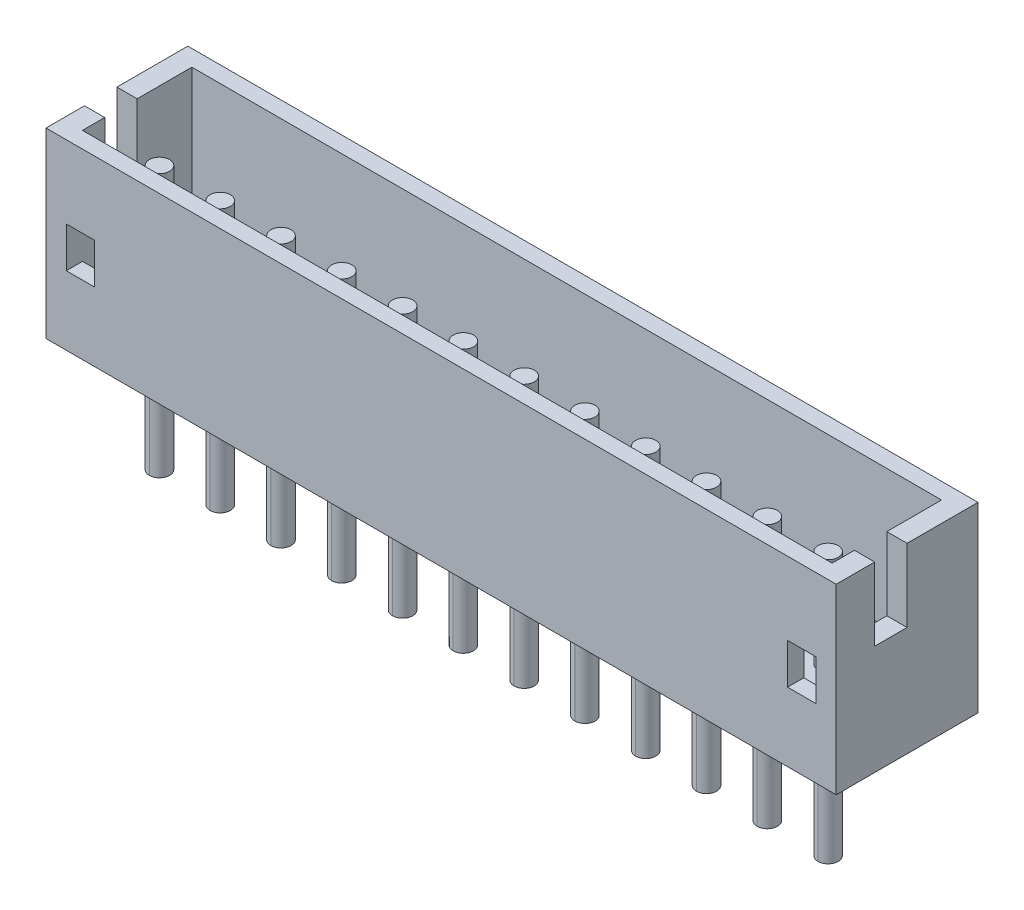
ISO-10303-21;
HEADER;
FILE_DESCRIPTION(('STEP AP214'),'2;1');
FILE_NAME('part.step','',(''),(''),'','','');
FILE_SCHEMA(('AUTOMOTIVE_DESIGN { 1 0 10303 214 1 1 1 1 }'));
ENDSEC;
DATA;
#1=APPLICATION_CONTEXT('core data for automotive mechanical design processes');
#2=APPLICATION_PROTOCOL_DEFINITION('international standard','automotive_design',2000,#1);
#3=PRODUCT_CONTEXT('',#1,'mechanical');
#4=PRODUCT('Part','Part','',(#3));
#5=PRODUCT_RELATED_PRODUCT_CATEGORY('part','',(#4));
#6=PRODUCT_DEFINITION_FORMATION('','',#4);
#7=PRODUCT_DEFINITION_CONTEXT('part definition',#1,'design');
#8=PRODUCT_DEFINITION('design','',#6,#7);
#9=PRODUCT_DEFINITION_SHAPE('','',#8);
#10=(LENGTH_UNIT() NAMED_UNIT(*) SI_UNIT(.MILLI.,.METRE.));
#11=(NAMED_UNIT(*) PLANE_ANGLE_UNIT() SI_UNIT($,.RADIAN.));
#12=(NAMED_UNIT(*) SI_UNIT($,.STERADIAN.) SOLID_ANGLE_UNIT());
#13=UNCERTAINTY_MEASURE_WITH_UNIT(LENGTH_MEASURE(1.E-05),#10,'distance_accuracy_value','');
#14=(GEOMETRIC_REPRESENTATION_CONTEXT(3) GLOBAL_UNCERTAINTY_ASSIGNED_CONTEXT((#13)) GLOBAL_UNIT_ASSIGNED_CONTEXT((#10,
#11,#12)) REPRESENTATION_CONTEXT('',''));
#15=CARTESIAN_POINT('',(0.,0.,0.));
#16=DIRECTION('',(0.,0.,1.));
#17=DIRECTION('',(1.,0.,0.));
#18=AXIS2_PLACEMENT_3D('',#15,#16,#17);
#19=CARTESIAN_POINT('',(-2.25,-2.7,-1.3));
#20=DIRECTION('',(0.,1.,0.));
#21=DIRECTION('',(1.,0.,0.));
#22=AXIS2_PLACEMENT_3D('',#19,#20,#21);
#23=PLANE('',#22);
#24=CARTESIAN_POINT('',(-2.25,-2.7,-1.3));
#25=DIRECTION('',(0.,1.,0.));
#26=DIRECTION('',(0.,0.,1.));
#27=AXIS2_PLACEMENT_3D('',#24,#25,#26);
#28=CIRCLE('',#27,0.25);
#29=CARTESIAN_POINT('',(-2.25,-2.7,-1.05));
#30=VERTEX_POINT('',#29);
#31=CARTESIAN_POINT('',(-2.25,-2.7,-1.55));
#32=VERTEX_POINT('',#31);
#33=EDGE_CURVE('E830',#30,#32,#28,.T.);
#34=ORIENTED_EDGE('',*,*,#33,.F.);
#35=CARTESIAN_POINT('',(-2.25,-2.7,-1.3));
#36=DIRECTION('',(0.,1.,0.));
#37=DIRECTION('',(0.,0.,1.));
#38=AXIS2_PLACEMENT_3D('',#35,#36,#37);
#39=CIRCLE('',#38,0.25);
#40=EDGE_CURVE('E37',#32,#30,#39,.T.);
#41=ORIENTED_EDGE('',*,*,#40,.F.);
#42=EDGE_LOOP('',(#34,#41));
#43=FACE_BOUND('',#42,.T.);
#44=ADVANCED_FACE('F16',(#43),#23,.F.);
#45=CARTESIAN_POINT('',(5.25,-2.7,-1.3));
#46=DIRECTION('',(0.,1.,0.));
#47=DIRECTION('',(1.,0.,0.));
#48=AXIS2_PLACEMENT_3D('',#45,#46,#47);
#49=PLANE('',#48);
#50=CARTESIAN_POINT('',(5.25,-2.7,-1.3));
#51=DIRECTION('',(0.,1.,0.));
#52=DIRECTION('',(0.,0.,1.));
#53=AXIS2_PLACEMENT_3D('',#50,#51,#52);
#54=CIRCLE('',#53,0.25);
#55=CARTESIAN_POINT('',(5.25,-2.7,-1.05));
#56=VERTEX_POINT('',#55);
#57=CARTESIAN_POINT('',(5.25,-2.7,-1.55));
#58=VERTEX_POINT('',#57);
#59=EDGE_CURVE('E822',#56,#58,#54,.T.);
#60=ORIENTED_EDGE('',*,*,#59,.F.);
#61=CARTESIAN_POINT('',(5.25,-2.7,-1.3));
#62=DIRECTION('',(0.,1.,0.));
#63=DIRECTION('',(0.,0.,1.));
#64=AXIS2_PLACEMENT_3D('',#61,#62,#63);
#65=CIRCLE('',#64,0.25);
#66=EDGE_CURVE('E10',#58,#56,#65,.T.);
#67=ORIENTED_EDGE('',*,*,#66,.F.);
#68=EDGE_LOOP('',(#60,#67));
#69=FACE_BOUND('',#68,.T.);
#70=ADVANCED_FACE('F18',(#69),#49,.F.);
#71=CARTESIAN_POINT('',(0.75,-2.7,-1.3));
#72=DIRECTION('',(0.,1.,0.));
#73=DIRECTION('',(1.,0.,0.));
#74=AXIS2_PLACEMENT_3D('',#71,#72,#73);
#75=PLANE('',#74);
#76=CARTESIAN_POINT('',(0.75,-2.7,-1.3));
#77=DIRECTION('',(0.,1.,0.));
#78=DIRECTION('',(0.,0.,1.));
#79=AXIS2_PLACEMENT_3D('',#76,#77,#78);
#80=CIRCLE('',#79,0.25);
#81=CARTESIAN_POINT('',(0.75,-2.7,-1.05));
#82=VERTEX_POINT('',#81);
#83=CARTESIAN_POINT('',(0.75,-2.7,-1.55));
#84=VERTEX_POINT('',#83);
#85=EDGE_CURVE('E819',#82,#84,#80,.T.);
#86=ORIENTED_EDGE('',*,*,#85,.F.);
#87=CARTESIAN_POINT('',(0.75,-2.7,-1.3));
#88=DIRECTION('',(0.,1.,0.));
#89=DIRECTION('',(0.,0.,1.));
#90=AXIS2_PLACEMENT_3D('',#87,#88,#89);
#91=CIRCLE('',#90,0.25);
#92=EDGE_CURVE('E809',#84,#82,#91,.T.);
#93=ORIENTED_EDGE('',*,*,#92,.F.);
#94=EDGE_LOOP('',(#86,#93));
#95=FACE_BOUND('',#94,.T.);
#96=ADVANCED_FACE('F1339',(#95),#75,.F.);
#97=CARTESIAN_POINT('',(-8.25,-2.7,-1.3));
#98=DIRECTION('',(0.,1.,0.));
#99=DIRECTION('',(1.,0.,0.));
#100=AXIS2_PLACEMENT_3D('',#97,#98,#99);
#101=PLANE('',#100);
#102=CARTESIAN_POINT('',(-8.25,-2.7,-1.3));
#103=DIRECTION('',(0.,1.,0.));
#104=DIRECTION('',(0.,0.,1.));
#105=AXIS2_PLACEMENT_3D('',#102,#103,#104);
#106=CIRCLE('',#105,0.25);
#107=CARTESIAN_POINT('',(-8.25,-2.7,-1.05));
#108=VERTEX_POINT('',#107);
#109=CARTESIAN_POINT('',(-8.25,-2.7,-1.55));
#110=VERTEX_POINT('',#109);
#111=EDGE_CURVE('E788',#108,#110,#106,.T.);
#112=ORIENTED_EDGE('',*,*,#111,.F.);
#113=CARTESIAN_POINT('',(-8.25,-2.7,-1.3));
#114=DIRECTION('',(0.,1.,0.));
#115=DIRECTION('',(0.,0.,1.));
#116=AXIS2_PLACEMENT_3D('',#113,#114,#115);
#117=CIRCLE('',#116,0.25);
#118=EDGE_CURVE('E843',#110,#108,#117,.T.);
#119=ORIENTED_EDGE('',*,*,#118,.F.);
#120=EDGE_LOOP('',(#112,#119));
#121=FACE_BOUND('',#120,.T.);
#122=ADVANCED_FACE('F1405',(#121),#101,.F.);
#123=CARTESIAN_POINT('',(-6.75,-2.7,-1.3));
#124=DIRECTION('',(0.,1.,0.));
#125=DIRECTION('',(1.,0.,0.));
#126=AXIS2_PLACEMENT_3D('',#123,#124,#125);
#127=PLANE('',#126);
#128=CARTESIAN_POINT('',(-6.75,-2.7,-1.3));
#129=DIRECTION('',(0.,1.,0.));
#130=DIRECTION('',(0.,0.,1.));
#131=AXIS2_PLACEMENT_3D('',#128,#129,#130);
#132=CIRCLE('',#131,0.25);
#133=CARTESIAN_POINT('',(-6.75,-2.7,-1.05));
#134=VERTEX_POINT('',#133);
#135=CARTESIAN_POINT('',(-6.75,-2.7,-1.55));
#136=VERTEX_POINT('',#135);
#137=EDGE_CURVE('E798',#134,#136,#132,.T.);
#138=ORIENTED_EDGE('',*,*,#137,.F.);
#139=CARTESIAN_POINT('',(-6.75,-2.7,-1.3));
#140=DIRECTION('',(0.,1.,0.));
#141=DIRECTION('',(0.,0.,1.));
#142=AXIS2_PLACEMENT_3D('',#139,#140,#141);
#143=CIRCLE('',#142,0.25);
#144=EDGE_CURVE('E709',#136,#134,#143,.T.);
#145=ORIENTED_EDGE('',*,*,#144,.F.);
#146=EDGE_LOOP('',(#138,#145));
#147=FACE_BOUND('',#146,.T.);
#148=ADVANCED_FACE('F1402',(#147),#127,.F.);
#149=CARTESIAN_POINT('',(6.75,-2.7,-1.3));
#150=DIRECTION('',(0.,1.,0.));
#151=DIRECTION('',(1.,0.,0.));
#152=AXIS2_PLACEMENT_3D('',#149,#150,#151);
#153=PLANE('',#152);
#154=CARTESIAN_POINT('',(6.75,-2.7,-1.3));
#155=DIRECTION('',(0.,1.,0.));
#156=DIRECTION('',(0.,0.,1.));
#157=AXIS2_PLACEMENT_3D('',#154,#155,#156);
#158=CIRCLE('',#157,0.25);
#159=CARTESIAN_POINT('',(6.75,-2.7,-1.05));
#160=VERTEX_POINT('',#159);
#161=CARTESIAN_POINT('',(6.75,-2.7,-1.55));
#162=VERTEX_POINT('',#161);
#163=EDGE_CURVE('E840',#160,#162,#158,.T.);
#164=ORIENTED_EDGE('',*,*,#163,.F.);
#165=CARTESIAN_POINT('',(6.75,-2.7,-1.3));
#166=DIRECTION('',(0.,1.,0.));
#167=DIRECTION('',(0.,0.,1.));
#168=AXIS2_PLACEMENT_3D('',#165,#166,#167);
#169=CIRCLE('',#168,0.25);
#170=EDGE_CURVE('E776',#162,#160,#169,.T.);
#171=ORIENTED_EDGE('',*,*,#170,.F.);
#172=EDGE_LOOP('',(#164,#171));
#173=FACE_BOUND('',#172,.T.);
#174=ADVANCED_FACE('F1399',(#173),#153,.F.);
#175=CARTESIAN_POINT('',(8.25,-2.7,-1.3));
#176=DIRECTION('',(0.,1.,0.));
#177=DIRECTION('',(1.,0.,0.));
#178=AXIS2_PLACEMENT_3D('',#175,#176,#177);
#179=PLANE('',#178);
#180=CARTESIAN_POINT('',(8.25,-2.7,-1.3));
#181=DIRECTION('',(0.,1.,0.));
#182=DIRECTION('',(0.,0.,1.));
#183=AXIS2_PLACEMENT_3D('',#180,#181,#182);
#184=CIRCLE('',#183,0.25);
#185=CARTESIAN_POINT('',(8.25,-2.7,-1.05));
#186=VERTEX_POINT('',#185);
#187=CARTESIAN_POINT('',(8.25,-2.7,-1.55));
#188=VERTEX_POINT('',#187);
#189=EDGE_CURVE('E847',#186,#188,#184,.T.);
#190=ORIENTED_EDGE('',*,*,#189,.F.);
#191=CARTESIAN_POINT('',(8.25,-2.7,-1.3));
#192=DIRECTION('',(0.,1.,0.));
#193=DIRECTION('',(0.,0.,1.));
#194=AXIS2_PLACEMENT_3D('',#191,#192,#193);
#195=CIRCLE('',#194,0.25);
#196=EDGE_CURVE('E767',#188,#186,#195,.T.);
#197=ORIENTED_EDGE('',*,*,#196,.F.);
#198=EDGE_LOOP('',(#190,#197));
#199=FACE_BOUND('',#198,.T.);
#200=ADVANCED_FACE('F1395',(#199),#179,.F.);
#201=CARTESIAN_POINT('',(3.75,-2.7,-1.3));
#202=DIRECTION('',(0.,1.,0.));
#203=DIRECTION('',(1.,0.,0.));
#204=AXIS2_PLACEMENT_3D('',#201,#202,#203);
#205=PLANE('',#204);
#206=CARTESIAN_POINT('',(3.75,-2.7,-1.3));
#207=DIRECTION('',(0.,1.,0.));
#208=DIRECTION('',(0.,0.,1.));
#209=AXIS2_PLACEMENT_3D('',#206,#207,#208);
#210=CIRCLE('',#209,0.25);
#211=CARTESIAN_POINT('',(3.75,-2.7,-1.05));
#212=VERTEX_POINT('',#211);
#213=CARTESIAN_POINT('',(3.75,-2.7,-1.55));
#214=VERTEX_POINT('',#213);
#215=EDGE_CURVE('E759',#212,#214,#210,.T.);
#216=ORIENTED_EDGE('',*,*,#215,.F.);
#217=CARTESIAN_POINT('',(3.75,-2.7,-1.3));
#218=DIRECTION('',(0.,1.,0.));
#219=DIRECTION('',(0.,0.,1.));
#220=AXIS2_PLACEMENT_3D('',#217,#218,#219);
#221=CIRCLE('',#220,0.25);
#222=EDGE_CURVE('E837',#214,#212,#221,.T.);
#223=ORIENTED_EDGE('',*,*,#222,.F.);
#224=EDGE_LOOP('',(#216,#223));
#225=FACE_BOUND('',#224,.T.);
#226=ADVANCED_FACE('F1398',(#225),#205,.F.);
#227=CARTESIAN_POINT('',(-0.75,-2.7,-1.3));
#228=DIRECTION('',(0.,1.,0.));
#229=DIRECTION('',(1.,0.,0.));
#230=AXIS2_PLACEMENT_3D('',#227,#228,#229);
#231=PLANE('',#230);
#232=CARTESIAN_POINT('',(-0.75,-2.7,-1.3));
#233=DIRECTION('',(0.,1.,0.));
#234=DIRECTION('',(0.,0.,1.));
#235=AXIS2_PLACEMENT_3D('',#232,#233,#234);
#236=CIRCLE('',#235,0.25);
#237=CARTESIAN_POINT('',(-0.75,-2.7,-1.05));
#238=VERTEX_POINT('',#237);
#239=CARTESIAN_POINT('',(-0.75,-2.7,-1.55));
#240=VERTEX_POINT('',#239);
#241=EDGE_CURVE('E816',#238,#240,#236,.T.);
#242=ORIENTED_EDGE('',*,*,#241,.F.);
#243=CARTESIAN_POINT('',(-0.75,-2.7,-1.3));
#244=DIRECTION('',(0.,1.,0.));
#245=DIRECTION('',(0.,0.,1.));
#246=AXIS2_PLACEMENT_3D('',#243,#244,#245);
#247=CIRCLE('',#246,0.25);
#248=EDGE_CURVE('E749',#240,#238,#247,.T.);
#249=ORIENTED_EDGE('',*,*,#248,.F.);
#250=EDGE_LOOP('',(#242,#249));
#251=FACE_BOUND('',#250,.T.);
#252=ADVANCED_FACE('F1436',(#251),#231,.F.);
#253=CARTESIAN_POINT('',(-3.75,-2.7,-1.3));
#254=DIRECTION('',(0.,1.,0.));
#255=DIRECTION('',(1.,0.,0.));
#256=AXIS2_PLACEMENT_3D('',#253,#254,#255);
#257=PLANE('',#256);
#258=CARTESIAN_POINT('',(-3.75,-2.7,-1.3));
#259=DIRECTION('',(0.,1.,0.));
#260=DIRECTION('',(0.,0.,1.));
#261=AXIS2_PLACEMENT_3D('',#258,#259,#260);
#262=CIRCLE('',#261,0.25);
#263=CARTESIAN_POINT('',(-3.75,-2.7,-1.05));
#264=VERTEX_POINT('',#263);
#265=CARTESIAN_POINT('',(-3.75,-2.7,-1.55));
#266=VERTEX_POINT('',#265);
#267=EDGE_CURVE('E802',#264,#266,#262,.T.);
#268=ORIENTED_EDGE('',*,*,#267,.F.);
#269=CARTESIAN_POINT('',(-3.75,-2.7,-1.3));
#270=DIRECTION('',(0.,1.,0.));
#271=DIRECTION('',(0.,0.,1.));
#272=AXIS2_PLACEMENT_3D('',#269,#270,#271);
#273=CIRCLE('',#272,0.25);
#274=EDGE_CURVE('E741',#266,#264,#273,.T.);
#275=ORIENTED_EDGE('',*,*,#274,.F.);
#276=EDGE_LOOP('',(#268,#275));
#277=FACE_BOUND('',#276,.T.);
#278=ADVANCED_FACE('F1440',(#277),#257,.F.);
#279=CARTESIAN_POINT('',(-5.25,-2.7,-1.3));
#280=DIRECTION('',(0.,1.,0.));
#281=DIRECTION('',(1.,0.,0.));
#282=AXIS2_PLACEMENT_3D('',#279,#280,#281);
#283=PLANE('',#282);
#284=CARTESIAN_POINT('',(-5.25,-2.7,-1.3));
#285=DIRECTION('',(0.,1.,0.));
#286=DIRECTION('',(0.,0.,1.));
#287=AXIS2_PLACEMENT_3D('',#284,#285,#286);
#288=CIRCLE('',#287,0.25);
#289=CARTESIAN_POINT('',(-5.25,-2.7,-1.05));
#290=VERTEX_POINT('',#289);
#291=CARTESIAN_POINT('',(-5.25,-2.7,-1.55));
#292=VERTEX_POINT('',#291);
#293=EDGE_CURVE('E730',#290,#292,#288,.T.);
#294=ORIENTED_EDGE('',*,*,#293,.F.);
#295=CARTESIAN_POINT('',(-5.25,-2.7,-1.3));
#296=DIRECTION('',(0.,1.,0.));
#297=DIRECTION('',(0.,0.,1.));
#298=AXIS2_PLACEMENT_3D('',#295,#296,#297);
#299=CIRCLE('',#298,0.25);
#300=EDGE_CURVE('E25',#292,#290,#299,.T.);
#301=ORIENTED_EDGE('',*,*,#300,.F.);
#302=EDGE_LOOP('',(#294,#301));
#303=FACE_BOUND('',#302,.T.);
#304=ADVANCED_FACE('F1393',(#303),#283,.F.);
#305=CARTESIAN_POINT('',(2.25,-2.7,-1.3));
#306=DIRECTION('',(0.,1.,0.));
#307=DIRECTION('',(1.,0.,0.));
#308=AXIS2_PLACEMENT_3D('',#305,#306,#307);
#309=PLANE('',#308);
#310=CARTESIAN_POINT('',(2.25,-2.7,-1.3));
#311=DIRECTION('',(0.,1.,0.));
#312=DIRECTION('',(0.,0.,1.));
#313=AXIS2_PLACEMENT_3D('',#310,#311,#312);
#314=CIRCLE('',#313,0.25);
#315=CARTESIAN_POINT('',(2.25,-2.7,-1.05));
#316=VERTEX_POINT('',#315);
#317=CARTESIAN_POINT('',(2.25,-2.7,-1.55));
#318=VERTEX_POINT('',#317);
#319=EDGE_CURVE('E640',#316,#318,#314,.T.);
#320=ORIENTED_EDGE('',*,*,#319,.F.);
#321=CARTESIAN_POINT('',(2.25,-2.7,-1.3));
#322=DIRECTION('',(0.,1.,0.));
#323=DIRECTION('',(0.,0.,1.));
#324=AXIS2_PLACEMENT_3D('',#321,#322,#323);
#325=CIRCLE('',#324,0.25);
#326=EDGE_CURVE('E756',#318,#316,#325,.T.);
#327=ORIENTED_EDGE('',*,*,#326,.F.);
#328=EDGE_LOOP('',(#320,#327));
#329=FACE_BOUND('',#328,.T.);
#330=ADVANCED_FACE('F1389',(#329),#309,.F.);
#331=CARTESIAN_POINT('',(5.25,-2.7,-1.3));
#332=DIRECTION('',(0.,1.,0.));
#333=DIRECTION('',(0.,0.,1.));
#334=AXIS2_PLACEMENT_3D('',#331,#332,#333);
#335=CYLINDRICAL_SURFACE('',#334,0.25);
#336=DIRECTION('',(0.,1.,0.));
#337=VECTOR('',#336,1.);
#338=CARTESIAN_POINT('',(5.25,-2.7,-1.55));
#339=LINE('',#338,#337);
#340=CARTESIAN_POINT('',(5.25,0.,-1.55));
#341=VERTEX_POINT('',#340);
#342=EDGE_CURVE('E803',#58,#341,#339,.T.);
#343=ORIENTED_EDGE('',*,*,#342,.F.);
#344=ORIENTED_EDGE('',*,*,#66,.T.);
#345=DIRECTION('',(0.,1.,0.));
#346=VECTOR('',#345,1.);
#347=CARTESIAN_POINT('',(5.25,-2.7,-1.05));
#348=LINE('',#347,#346);
#349=CARTESIAN_POINT('',(5.25,0.,-1.05));
#350=VERTEX_POINT('',#349);
#351=EDGE_CURVE('E799',#56,#350,#348,.T.);
#352=ORIENTED_EDGE('',*,*,#351,.T.);
#353=CARTESIAN_POINT('',(5.25,0.,-1.3));
#354=DIRECTION('',(0.,1.,0.));
#355=DIRECTION('',(0.,0.,1.));
#356=AXIS2_PLACEMENT_3D('',#353,#354,#355);
#357=CIRCLE('',#356,0.25);
#358=EDGE_CURVE('E1174',#341,#350,#357,.T.);
#359=ORIENTED_EDGE('',*,*,#358,.F.);
#360=EDGE_LOOP('',(#343,#344,#352,#359));
#361=FACE_BOUND('',#360,.T.);
#362=ADVANCED_FACE('F1386',(#361),#335,.T.);
#363=CARTESIAN_POINT('',(-5.25,-2.7,-1.3));
#364=DIRECTION('',(0.,1.,0.));
#365=DIRECTION('',(0.,0.,1.));
#366=AXIS2_PLACEMENT_3D('',#363,#364,#365);
#367=CYLINDRICAL_SURFACE('',#366,0.25);
#368=DIRECTION('',(0.,1.,0.));
#369=VECTOR('',#368,1.);
#370=CARTESIAN_POINT('',(-5.25,-2.7,-1.55));
#371=LINE('',#370,#369);
#372=CARTESIAN_POINT('',(-5.25,0.,-1.55));
#373=VERTEX_POINT('',#372);
#374=EDGE_CURVE('E734',#292,#373,#371,.T.);
#375=ORIENTED_EDGE('',*,*,#374,.F.);
#376=ORIENTED_EDGE('',*,*,#300,.T.);
#377=DIRECTION('',(0.,1.,0.));
#378=VECTOR('',#377,1.);
#379=CARTESIAN_POINT('',(-5.25,-2.7,-1.05));
#380=LINE('',#379,#378);
#381=CARTESIAN_POINT('',(-5.25,0.,-1.05));
#382=VERTEX_POINT('',#381);
#383=EDGE_CURVE('E737',#290,#382,#380,.T.);
#384=ORIENTED_EDGE('',*,*,#383,.T.);
#385=CARTESIAN_POINT('',(-5.25,0.,-1.3));
#386=DIRECTION('',(0.,1.,0.));
#387=DIRECTION('',(0.,0.,1.));
#388=AXIS2_PLACEMENT_3D('',#385,#386,#387);
#389=CIRCLE('',#388,0.25);
#390=EDGE_CURVE('E701',#373,#382,#389,.T.);
#391=ORIENTED_EDGE('',*,*,#390,.F.);
#392=EDGE_LOOP('',(#375,#376,#384,#391));
#393=FACE_BOUND('',#392,.T.);
#394=ADVANCED_FACE('F1383',(#393),#367,.T.);
#395=CARTESIAN_POINT('',(8.25,-2.7,-1.3));
#396=DIRECTION('',(0.,1.,0.));
#397=DIRECTION('',(0.,0.,1.));
#398=AXIS2_PLACEMENT_3D('',#395,#396,#397);
#399=CYLINDRICAL_SURFACE('',#398,0.25);
#400=ORIENTED_EDGE('',*,*,#189,.T.);
#401=DIRECTION('',(0.,1.,0.));
#402=VECTOR('',#401,1.);
#403=CARTESIAN_POINT('',(8.25,-2.7,-1.55));
#404=LINE('',#403,#402);
#405=CARTESIAN_POINT('',(8.25,0.,-1.55));
#406=VERTEX_POINT('',#405);
#407=EDGE_CURVE('E764',#188,#406,#404,.T.);
#408=ORIENTED_EDGE('',*,*,#407,.T.);
#409=CARTESIAN_POINT('',(8.25,0.,-1.3));
#410=DIRECTION('',(0.,1.,0.));
#411=DIRECTION('',(0.,0.,1.));
#412=AXIS2_PLACEMENT_3D('',#409,#410,#411);
#413=CIRCLE('',#412,0.25);
#414=CARTESIAN_POINT('',(8.25,0.,-1.05));
#415=VERTEX_POINT('',#414);
#416=EDGE_CURVE('E878',#415,#406,#413,.T.);
#417=ORIENTED_EDGE('',*,*,#416,.F.);
#418=DIRECTION('',(0.,1.,0.));
#419=VECTOR('',#418,1.);
#420=CARTESIAN_POINT('',(8.25,-2.7,-1.05));
#421=LINE('',#420,#419);
#422=EDGE_CURVE('E772',#186,#415,#421,.T.);
#423=ORIENTED_EDGE('',*,*,#422,.F.);
#424=EDGE_LOOP('',(#400,#408,#417,#423));
#425=FACE_BOUND('',#424,.T.);
#426=ADVANCED_FACE('F1382',(#425),#399,.T.);
#427=CARTESIAN_POINT('',(-2.25,-2.7,-1.3));
#428=DIRECTION('',(0.,1.,0.));
#429=DIRECTION('',(0.,0.,1.));
#430=AXIS2_PLACEMENT_3D('',#427,#428,#429);
#431=CYLINDRICAL_SURFACE('',#430,0.25);
#432=DIRECTION('',(0.,1.,0.));
#433=VECTOR('',#432,1.);
#434=CARTESIAN_POINT('',(-2.25,-2.7,-1.55));
#435=LINE('',#434,#433);
#436=CARTESIAN_POINT('',(-2.25,0.,-1.55));
#437=VERTEX_POINT('',#436);
#438=EDGE_CURVE('E831',#32,#437,#435,.T.);
#439=ORIENTED_EDGE('',*,*,#438,.F.);
#440=ORIENTED_EDGE('',*,*,#40,.T.);
#441=DIRECTION('',(0.,1.,0.));
#442=VECTOR('',#441,1.);
#443=CARTESIAN_POINT('',(-2.25,-2.7,-1.05));
#444=LINE('',#443,#442);
#445=CARTESIAN_POINT('',(-2.25,0.,-1.05));
#446=VERTEX_POINT('',#445);
#447=EDGE_CURVE('E834',#30,#446,#444,.T.);
#448=ORIENTED_EDGE('',*,*,#447,.T.);
#449=CARTESIAN_POINT('',(-2.25,0.,-1.3));
#450=DIRECTION('',(0.,1.,0.));
#451=DIRECTION('',(0.,0.,1.));
#452=AXIS2_PLACEMENT_3D('',#449,#450,#451);
#453=CIRCLE('',#452,0.25);
#454=EDGE_CURVE('E685',#437,#446,#453,.T.);
#455=ORIENTED_EDGE('',*,*,#454,.F.);
#456=EDGE_LOOP('',(#439,#440,#448,#455));
#457=FACE_BOUND('',#456,.T.);
#458=ADVANCED_FACE('F1378',(#457),#431,.T.);
#459=CARTESIAN_POINT('',(-8.25,-2.7,-1.3));
#460=DIRECTION('',(0.,1.,0.));
#461=DIRECTION('',(0.,0.,1.));
#462=AXIS2_PLACEMENT_3D('',#459,#460,#461);
#463=CYLINDRICAL_SURFACE('',#462,0.25);
#464=DIRECTION('',(0.,1.,0.));
#465=VECTOR('',#464,1.);
#466=CARTESIAN_POINT('',(-8.25,-2.7,-1.55));
#467=LINE('',#466,#465);
#468=CARTESIAN_POINT('',(-8.25,0.,-1.55));
#469=VERTEX_POINT('',#468);
#470=EDGE_CURVE('E792',#110,#469,#467,.T.);
#471=ORIENTED_EDGE('',*,*,#470,.F.);
#472=ORIENTED_EDGE('',*,*,#118,.T.);
#473=DIRECTION('',(0.,1.,0.));
#474=VECTOR('',#473,1.);
#475=CARTESIAN_POINT('',(-8.25,-2.7,-1.05));
#476=LINE('',#475,#474);
#477=CARTESIAN_POINT('',(-8.25,0.,-1.05));
#478=VERTEX_POINT('',#477);
#479=EDGE_CURVE('E795',#108,#478,#476,.T.);
#480=ORIENTED_EDGE('',*,*,#479,.T.);
#481=CARTESIAN_POINT('',(-8.25,0.,-1.3));
#482=DIRECTION('',(0.,1.,0.));
#483=DIRECTION('',(0.,0.,1.));
#484=AXIS2_PLACEMENT_3D('',#481,#482,#483);
#485=CIRCLE('',#484,0.25);
#486=EDGE_CURVE('E722',#469,#478,#485,.T.);
#487=ORIENTED_EDGE('',*,*,#486,.F.);
#488=EDGE_LOOP('',(#471,#472,#480,#487));
#489=FACE_BOUND('',#488,.T.);
#490=ADVANCED_FACE('F1374',(#489),#463,.T.);
#491=CARTESIAN_POINT('',(6.75,-2.7,-1.3));
#492=DIRECTION('',(0.,1.,0.));
#493=DIRECTION('',(0.,0.,1.));
#494=AXIS2_PLACEMENT_3D('',#491,#492,#493);
#495=CYLINDRICAL_SURFACE('',#494,0.25);
#496=ORIENTED_EDGE('',*,*,#163,.T.);
#497=DIRECTION('',(0.,1.,0.));
#498=VECTOR('',#497,1.);
#499=CARTESIAN_POINT('',(6.75,-2.7,-1.55));
#500=LINE('',#499,#498);
#501=CARTESIAN_POINT('',(6.75,0.,-1.55));
#502=VERTEX_POINT('',#501);
#503=EDGE_CURVE('E773',#162,#502,#500,.T.);
#504=ORIENTED_EDGE('',*,*,#503,.T.);
#505=CARTESIAN_POINT('',(6.75,0.,-1.3));
#506=DIRECTION('',(0.,1.,0.));
#507=DIRECTION('',(0.,0.,1.));
#508=AXIS2_PLACEMENT_3D('',#505,#506,#507);
#509=CIRCLE('',#508,0.25);
#510=CARTESIAN_POINT('',(6.75,0.,-1.05));
#511=VERTEX_POINT('',#510);
#512=EDGE_CURVE('E1163',#511,#502,#509,.T.);
#513=ORIENTED_EDGE('',*,*,#512,.F.);
#514=DIRECTION('',(0.,1.,0.));
#515=VECTOR('',#514,1.);
#516=CARTESIAN_POINT('',(6.75,-2.7,-1.05));
#517=LINE('',#516,#515);
#518=EDGE_CURVE('E710',#160,#511,#517,.T.);
#519=ORIENTED_EDGE('',*,*,#518,.F.);
#520=EDGE_LOOP('',(#496,#504,#513,#519));
#521=FACE_BOUND('',#520,.T.);
#522=ADVANCED_FACE('F1371',(#521),#495,.T.);
#523=CARTESIAN_POINT('',(3.75,-2.7,-1.3));
#524=DIRECTION('',(0.,1.,0.));
#525=DIRECTION('',(0.,0.,1.));
#526=AXIS2_PLACEMENT_3D('',#523,#524,#525);
#527=CYLINDRICAL_SURFACE('',#526,0.25);
#528=DIRECTION('',(0.,1.,0.));
#529=VECTOR('',#528,1.);
#530=CARTESIAN_POINT('',(3.75,-2.7,-1.55));
#531=LINE('',#530,#529);
#532=CARTESIAN_POINT('',(3.75,0.,-1.55));
#533=VERTEX_POINT('',#532);
#534=EDGE_CURVE('E763',#214,#533,#531,.T.);
#535=ORIENTED_EDGE('',*,*,#534,.F.);
#536=ORIENTED_EDGE('',*,*,#222,.T.);
#537=DIRECTION('',(0.,1.,0.));
#538=VECTOR('',#537,1.);
#539=CARTESIAN_POINT('',(3.75,-2.7,-1.05));
#540=LINE('',#539,#538);
#541=CARTESIAN_POINT('',(3.75,0.,-1.05));
#542=VERTEX_POINT('',#541);
#543=EDGE_CURVE('E768',#212,#542,#540,.T.);
#544=ORIENTED_EDGE('',*,*,#543,.T.);
#545=CARTESIAN_POINT('',(3.75,0.,-1.3));
#546=DIRECTION('',(0.,1.,0.));
#547=DIRECTION('',(0.,0.,1.));
#548=AXIS2_PLACEMENT_3D('',#545,#546,#547);
#549=CIRCLE('',#548,0.25);
#550=EDGE_CURVE('E655',#533,#542,#549,.T.);
#551=ORIENTED_EDGE('',*,*,#550,.F.);
#552=EDGE_LOOP('',(#535,#536,#544,#551));
#553=FACE_BOUND('',#552,.T.);
#554=ADVANCED_FACE('F1369',(#553),#527,.T.);
#555=CARTESIAN_POINT('',(-2.25,-2.7,-1.3));
#556=DIRECTION('',(0.,1.,0.));
#557=DIRECTION('',(0.,0.,1.));
#558=AXIS2_PLACEMENT_3D('',#555,#556,#557);
#559=CYLINDRICAL_SURFACE('',#558,0.25);
#560=ORIENTED_EDGE('',*,*,#33,.T.);
#561=ORIENTED_EDGE('',*,*,#438,.T.);
#562=CARTESIAN_POINT('',(-2.25,0.,-1.3));
#563=DIRECTION('',(0.,1.,0.));
#564=DIRECTION('',(0.,0.,1.));
#565=AXIS2_PLACEMENT_3D('',#562,#563,#564);
#566=CIRCLE('',#565,0.25);
#567=EDGE_CURVE('E681',#446,#437,#566,.T.);
#568=ORIENTED_EDGE('',*,*,#567,.F.);
#569=ORIENTED_EDGE('',*,*,#447,.F.);
#570=EDGE_LOOP('',(#560,#561,#568,#569));
#571=FACE_BOUND('',#570,.T.);
#572=ADVANCED_FACE('F1365',(#571),#559,.T.);
#573=CARTESIAN_POINT('',(-3.75,-2.7,-1.3));
#574=DIRECTION('',(0.,1.,0.));
#575=DIRECTION('',(0.,0.,1.));
#576=AXIS2_PLACEMENT_3D('',#573,#574,#575);
#577=CYLINDRICAL_SURFACE('',#576,0.25);
#578=ORIENTED_EDGE('',*,*,#267,.T.);
#579=DIRECTION('',(0.,1.,0.));
#580=VECTOR('',#579,1.);
#581=CARTESIAN_POINT('',(-3.75,-2.7,-1.55));
#582=LINE('',#581,#580);
#583=CARTESIAN_POINT('',(-3.75,0.,-1.55));
#584=VERTEX_POINT('',#583);
#585=EDGE_CURVE('E738',#266,#584,#582,.T.);
#586=ORIENTED_EDGE('',*,*,#585,.T.);
#587=CARTESIAN_POINT('',(-3.75,0.,-1.3));
#588=DIRECTION('',(0.,1.,0.));
#589=DIRECTION('',(0.,0.,1.));
#590=AXIS2_PLACEMENT_3D('',#587,#588,#589);
#591=CIRCLE('',#590,0.25);
#592=CARTESIAN_POINT('',(-3.75,0.,-1.05));
#593=VERTEX_POINT('',#592);
#594=EDGE_CURVE('E689',#593,#584,#591,.T.);
#595=ORIENTED_EDGE('',*,*,#594,.F.);
#596=DIRECTION('',(0.,1.,0.));
#597=VECTOR('',#596,1.);
#598=CARTESIAN_POINT('',(-3.75,-2.7,-1.05));
#599=LINE('',#598,#597);
#600=EDGE_CURVE('E745',#264,#593,#599,.T.);
#601=ORIENTED_EDGE('',*,*,#600,.F.);
#602=EDGE_LOOP('',(#578,#586,#595,#601));
#603=FACE_BOUND('',#602,.T.);
#604=ADVANCED_FACE('F1362',(#603),#577,.T.);
#605=CARTESIAN_POINT('',(5.25,-2.7,-1.3));
#606=DIRECTION('',(0.,1.,0.));
#607=DIRECTION('',(0.,0.,1.));
#608=AXIS2_PLACEMENT_3D('',#605,#606,#607);
#609=CYLINDRICAL_SURFACE('',#608,0.25);
#610=ORIENTED_EDGE('',*,*,#59,.T.);
#611=ORIENTED_EDGE('',*,*,#342,.T.);
#612=CARTESIAN_POINT('',(5.25,0.,-1.3));
#613=DIRECTION('',(0.,1.,0.));
#614=DIRECTION('',(0.,0.,1.));
#615=AXIS2_PLACEMENT_3D('',#612,#613,#614);
#616=CIRCLE('',#615,0.25);
#617=EDGE_CURVE('E1171',#350,#341,#616,.T.);
#618=ORIENTED_EDGE('',*,*,#617,.F.);
#619=ORIENTED_EDGE('',*,*,#351,.F.);
#620=EDGE_LOOP('',(#610,#611,#618,#619));
#621=FACE_BOUND('',#620,.T.);
#622=ADVANCED_FACE('F1360',(#621),#609,.T.);
#623=CARTESIAN_POINT('',(0.75,-2.7,-1.3));
#624=DIRECTION('',(0.,1.,0.));
#625=DIRECTION('',(0.,0.,1.));
#626=AXIS2_PLACEMENT_3D('',#623,#624,#625);
#627=CYLINDRICAL_SURFACE('',#626,0.25);
#628=ORIENTED_EDGE('',*,*,#85,.T.);
#629=DIRECTION('',(0.,1.,0.));
#630=VECTOR('',#629,1.);
#631=CARTESIAN_POINT('',(0.75,-2.7,-1.55));
#632=LINE('',#631,#630);
#633=CARTESIAN_POINT('',(0.75,0.,-1.55));
#634=VERTEX_POINT('',#633);
#635=EDGE_CURVE('E806',#84,#634,#632,.T.);
#636=ORIENTED_EDGE('',*,*,#635,.T.);
#637=CARTESIAN_POINT('',(0.75,0.,-1.3));
#638=DIRECTION('',(0.,1.,0.));
#639=DIRECTION('',(0.,0.,1.));
#640=AXIS2_PLACEMENT_3D('',#637,#638,#639);
#641=CIRCLE('',#640,0.25);
#642=CARTESIAN_POINT('',(0.75,0.,-1.05));
#643=VERTEX_POINT('',#642);
#644=EDGE_CURVE('E650',#643,#634,#641,.T.);
#645=ORIENTED_EDGE('',*,*,#644,.F.);
#646=DIRECTION('',(0.,1.,0.));
#647=VECTOR('',#646,1.);
#648=CARTESIAN_POINT('',(0.75,-2.7,-1.05));
#649=LINE('',#648,#647);
#650=EDGE_CURVE('E813',#82,#643,#649,.T.);
#651=ORIENTED_EDGE('',*,*,#650,.F.);
#652=EDGE_LOOP('',(#628,#636,#645,#651));
#653=FACE_BOUND('',#652,.T.);
#654=ADVANCED_FACE('F1356',(#653),#627,.T.);
#655=CARTESIAN_POINT('',(-0.75,-2.7,-1.3));
#656=DIRECTION('',(0.,1.,0.));
#657=DIRECTION('',(0.,0.,1.));
#658=AXIS2_PLACEMENT_3D('',#655,#656,#657);
#659=CYLINDRICAL_SURFACE('',#658,0.25);
#660=ORIENTED_EDGE('',*,*,#241,.T.);
#661=DIRECTION('',(0.,1.,0.));
#662=VECTOR('',#661,1.);
#663=CARTESIAN_POINT('',(-0.75,-2.7,-1.55));
#664=LINE('',#663,#662);
#665=CARTESIAN_POINT('',(-0.75,0.,-1.55));
#666=VERTEX_POINT('',#665);
#667=EDGE_CURVE('E746',#240,#666,#664,.T.);
#668=ORIENTED_EDGE('',*,*,#667,.T.);
#669=CARTESIAN_POINT('',(-0.75,0.,-1.3));
#670=DIRECTION('',(0.,1.,0.));
#671=DIRECTION('',(0.,0.,1.));
#672=AXIS2_PLACEMENT_3D('',#669,#670,#671);
#673=CIRCLE('',#672,0.25);
#674=CARTESIAN_POINT('',(-0.75,0.,-1.05));
#675=VERTEX_POINT('',#674);
#676=EDGE_CURVE('E673',#675,#666,#673,.T.);
#677=ORIENTED_EDGE('',*,*,#676,.F.);
#678=DIRECTION('',(0.,1.,0.));
#679=VECTOR('',#678,1.);
#680=CARTESIAN_POINT('',(-0.75,-2.7,-1.05));
#681=LINE('',#680,#679);
#682=EDGE_CURVE('E753',#238,#675,#681,.T.);
#683=ORIENTED_EDGE('',*,*,#682,.F.);
#684=EDGE_LOOP('',(#660,#668,#677,#683));
#685=FACE_BOUND('',#684,.T.);
#686=ADVANCED_FACE('F1352',(#685),#659,.T.);
#687=CARTESIAN_POINT('',(0.75,-2.7,-1.3));
#688=DIRECTION('',(0.,1.,0.));
#689=DIRECTION('',(0.,0.,1.));
#690=AXIS2_PLACEMENT_3D('',#687,#688,#689);
#691=CYLINDRICAL_SURFACE('',#690,0.25);
#692=ORIENTED_EDGE('',*,*,#635,.F.);
#693=ORIENTED_EDGE('',*,*,#92,.T.);
#694=ORIENTED_EDGE('',*,*,#650,.T.);
#695=CARTESIAN_POINT('',(0.75,0.,-1.3));
#696=DIRECTION('',(0.,1.,0.));
#697=DIRECTION('',(0.,0.,1.));
#698=AXIS2_PLACEMENT_3D('',#695,#696,#697);
#699=CIRCLE('',#698,0.25);
#700=EDGE_CURVE('E669',#634,#643,#699,.T.);
#701=ORIENTED_EDGE('',*,*,#700,.F.);
#702=EDGE_LOOP('',(#692,#693,#694,#701));
#703=FACE_BOUND('',#702,.T.);
#704=ADVANCED_FACE('F1348',(#703),#691,.T.);
#705=CARTESIAN_POINT('',(-6.75,-2.7,-1.3));
#706=DIRECTION('',(0.,1.,0.));
#707=DIRECTION('',(0.,0.,1.));
#708=AXIS2_PLACEMENT_3D('',#705,#706,#707);
#709=CYLINDRICAL_SURFACE('',#708,0.25);
#710=ORIENTED_EDGE('',*,*,#137,.T.);
#711=DIRECTION('',(0.,1.,0.));
#712=VECTOR('',#711,1.);
#713=CARTESIAN_POINT('',(-6.75,-2.7,-1.55));
#714=LINE('',#713,#712);
#715=CARTESIAN_POINT('',(-6.75,0.,-1.55));
#716=VERTEX_POINT('',#715);
#717=EDGE_CURVE('E706',#136,#716,#714,.T.);
#718=ORIENTED_EDGE('',*,*,#717,.T.);
#719=CARTESIAN_POINT('',(-6.75,0.,-1.3));
#720=DIRECTION('',(0.,1.,0.));
#721=DIRECTION('',(0.,0.,1.));
#722=AXIS2_PLACEMENT_3D('',#719,#720,#721);
#723=CIRCLE('',#722,0.25);
#724=CARTESIAN_POINT('',(-6.75,0.,-1.05));
#725=VERTEX_POINT('',#724);
#726=EDGE_CURVE('E705',#725,#716,#723,.T.);
#727=ORIENTED_EDGE('',*,*,#726,.F.);
#728=DIRECTION('',(0.,1.,0.));
#729=VECTOR('',#728,1.);
#730=CARTESIAN_POINT('',(-6.75,-2.7,-1.05));
#731=LINE('',#730,#729);
#732=EDGE_CURVE('E785',#134,#725,#731,.T.);
#733=ORIENTED_EDGE('',*,*,#732,.F.);
#734=EDGE_LOOP('',(#710,#718,#727,#733));
#735=FACE_BOUND('',#734,.T.);
#736=ADVANCED_FACE('F1345',(#735),#709,.T.);
#737=CARTESIAN_POINT('',(-8.25,-2.7,-1.3));
#738=DIRECTION('',(0.,1.,0.));
#739=DIRECTION('',(0.,0.,1.));
#740=AXIS2_PLACEMENT_3D('',#737,#738,#739);
#741=CYLINDRICAL_SURFACE('',#740,0.25);
#742=ORIENTED_EDGE('',*,*,#111,.T.);
#743=ORIENTED_EDGE('',*,*,#470,.T.);
#744=CARTESIAN_POINT('',(-8.25,0.,-1.3));
#745=DIRECTION('',(0.,1.,0.));
#746=DIRECTION('',(0.,0.,1.));
#747=AXIS2_PLACEMENT_3D('',#744,#745,#746);
#748=CIRCLE('',#747,0.25);
#749=EDGE_CURVE('E718',#478,#469,#748,.T.);
#750=ORIENTED_EDGE('',*,*,#749,.F.);
#751=ORIENTED_EDGE('',*,*,#479,.F.);
#752=EDGE_LOOP('',(#742,#743,#750,#751));
#753=FACE_BOUND('',#752,.T.);
#754=ADVANCED_FACE('F1343',(#753),#741,.T.);
#755=CARTESIAN_POINT('',(-6.75,-2.7,-1.3));
#756=DIRECTION('',(0.,1.,0.));
#757=DIRECTION('',(0.,0.,1.));
#758=AXIS2_PLACEMENT_3D('',#755,#756,#757);
#759=CYLINDRICAL_SURFACE('',#758,0.25);
#760=ORIENTED_EDGE('',*,*,#717,.F.);
#761=ORIENTED_EDGE('',*,*,#144,.T.);
#762=ORIENTED_EDGE('',*,*,#732,.T.);
#763=CARTESIAN_POINT('',(-6.75,0.,-1.3));
#764=DIRECTION('',(0.,1.,0.));
#765=DIRECTION('',(0.,0.,1.));
#766=AXIS2_PLACEMENT_3D('',#763,#764,#765);
#767=CIRCLE('',#766,0.25);
#768=EDGE_CURVE('E714',#716,#725,#767,.T.);
#769=ORIENTED_EDGE('',*,*,#768,.F.);
#770=EDGE_LOOP('',(#760,#761,#762,#769));
#771=FACE_BOUND('',#770,.T.);
#772=ADVANCED_FACE('F1456',(#771),#759,.T.);
#773=CARTESIAN_POINT('',(6.75,-2.7,-1.3));
#774=DIRECTION('',(0.,1.,0.));
#775=DIRECTION('',(0.,0.,1.));
#776=AXIS2_PLACEMENT_3D('',#773,#774,#775);
#777=CYLINDRICAL_SURFACE('',#776,0.25);
#778=ORIENTED_EDGE('',*,*,#503,.F.);
#779=ORIENTED_EDGE('',*,*,#170,.T.);
#780=ORIENTED_EDGE('',*,*,#518,.T.);
#781=CARTESIAN_POINT('',(6.75,0.,-1.3));
#782=DIRECTION('',(0.,1.,0.));
#783=DIRECTION('',(0.,0.,1.));
#784=AXIS2_PLACEMENT_3D('',#781,#782,#783);
#785=CIRCLE('',#784,0.25);
#786=EDGE_CURVE('E1167',#502,#511,#785,.T.);
#787=ORIENTED_EDGE('',*,*,#786,.F.);
#788=EDGE_LOOP('',(#778,#779,#780,#787));
#789=FACE_BOUND('',#788,.T.);
#790=ADVANCED_FACE('F1454',(#789),#777,.T.);
#791=CARTESIAN_POINT('',(8.25,-2.7,-1.3));
#792=DIRECTION('',(0.,1.,0.));
#793=DIRECTION('',(0.,0.,1.));
#794=AXIS2_PLACEMENT_3D('',#791,#792,#793);
#795=CYLINDRICAL_SURFACE('',#794,0.25);
#796=ORIENTED_EDGE('',*,*,#407,.F.);
#797=ORIENTED_EDGE('',*,*,#196,.T.);
#798=ORIENTED_EDGE('',*,*,#422,.T.);
#799=CARTESIAN_POINT('',(8.25,0.,-1.3));
#800=DIRECTION('',(0.,1.,0.));
#801=DIRECTION('',(0.,0.,1.));
#802=AXIS2_PLACEMENT_3D('',#799,#800,#801);
#803=CIRCLE('',#802,0.25);
#804=EDGE_CURVE('E1159',#406,#415,#803,.T.);
#805=ORIENTED_EDGE('',*,*,#804,.F.);
#806=EDGE_LOOP('',(#796,#797,#798,#805));
#807=FACE_BOUND('',#806,.T.);
#808=ADVANCED_FACE('F1452',(#807),#795,.T.);
#809=CARTESIAN_POINT('',(3.75,-2.7,-1.3));
#810=DIRECTION('',(0.,1.,0.));
#811=DIRECTION('',(0.,0.,1.));
#812=AXIS2_PLACEMENT_3D('',#809,#810,#811);
#813=CYLINDRICAL_SURFACE('',#812,0.25);
#814=ORIENTED_EDGE('',*,*,#215,.T.);
#815=ORIENTED_EDGE('',*,*,#534,.T.);
#816=CARTESIAN_POINT('',(3.75,0.,-1.3));
#817=DIRECTION('',(0.,1.,0.));
#818=DIRECTION('',(0.,0.,1.));
#819=AXIS2_PLACEMENT_3D('',#816,#817,#818);
#820=CIRCLE('',#819,0.25);
#821=EDGE_CURVE('E662',#542,#533,#820,.T.);
#822=ORIENTED_EDGE('',*,*,#821,.F.);
#823=ORIENTED_EDGE('',*,*,#543,.F.);
#824=EDGE_LOOP('',(#814,#815,#822,#823));
#825=FACE_BOUND('',#824,.T.);
#826=ADVANCED_FACE('F1449',(#825),#813,.T.);
#827=CARTESIAN_POINT('',(2.25,-2.7,-1.3));
#828=DIRECTION('',(0.,1.,0.));
#829=DIRECTION('',(0.,0.,1.));
#830=AXIS2_PLACEMENT_3D('',#827,#828,#829);
#831=CYLINDRICAL_SURFACE('',#830,0.25);
#832=DIRECTION('',(0.,1.,0.));
#833=VECTOR('',#832,1.);
#834=CARTESIAN_POINT('',(2.25,-2.7,-1.55));
#835=LINE('',#834,#833);
#836=CARTESIAN_POINT('',(2.25,0.,-1.55));
#837=VERTEX_POINT('',#836);
#838=EDGE_CURVE('E633',#318,#837,#835,.T.);
#839=ORIENTED_EDGE('',*,*,#838,.F.);
#840=ORIENTED_EDGE('',*,*,#326,.T.);
#841=DIRECTION('',(0.,1.,0.));
#842=VECTOR('',#841,1.);
#843=CARTESIAN_POINT('',(2.25,-2.7,-1.05));
#844=LINE('',#843,#842);
#845=CARTESIAN_POINT('',(2.25,0.,-1.05));
#846=VERTEX_POINT('',#845);
#847=EDGE_CURVE('E643',#316,#846,#844,.T.);
#848=ORIENTED_EDGE('',*,*,#847,.T.);
#849=CARTESIAN_POINT('',(2.25,0.,-1.3));
#850=DIRECTION('',(0.,1.,0.));
#851=DIRECTION('',(0.,0.,1.));
#852=AXIS2_PLACEMENT_3D('',#849,#850,#851);
#853=CIRCLE('',#852,0.25);
#854=EDGE_CURVE('E646',#837,#846,#853,.T.);
#855=ORIENTED_EDGE('',*,*,#854,.F.);
#856=EDGE_LOOP('',(#839,#840,#848,#855));
#857=FACE_BOUND('',#856,.T.);
#858=ADVANCED_FACE('F647',(#857),#831,.T.);
#859=CARTESIAN_POINT('',(-0.75,-2.7,-1.3));
#860=DIRECTION('',(0.,1.,0.));
#861=DIRECTION('',(0.,0.,1.));
#862=AXIS2_PLACEMENT_3D('',#859,#860,#861);
#863=CYLINDRICAL_SURFACE('',#862,0.25);
#864=ORIENTED_EDGE('',*,*,#667,.F.);
#865=ORIENTED_EDGE('',*,*,#248,.T.);
#866=ORIENTED_EDGE('',*,*,#682,.T.);
#867=CARTESIAN_POINT('',(-0.75,0.,-1.3));
#868=DIRECTION('',(0.,1.,0.));
#869=DIRECTION('',(0.,0.,1.));
#870=AXIS2_PLACEMENT_3D('',#867,#868,#869);
#871=CIRCLE('',#870,0.25);
#872=EDGE_CURVE('E677',#666,#675,#871,.T.);
#873=ORIENTED_EDGE('',*,*,#872,.F.);
#874=EDGE_LOOP('',(#864,#865,#866,#873));
#875=FACE_BOUND('',#874,.T.);
#876=ADVANCED_FACE('F1448',(#875),#863,.T.);
#877=CARTESIAN_POINT('',(-3.75,-2.7,-1.3));
#878=DIRECTION('',(0.,1.,0.));
#879=DIRECTION('',(0.,0.,1.));
#880=AXIS2_PLACEMENT_3D('',#877,#878,#879);
#881=CYLINDRICAL_SURFACE('',#880,0.25);
#882=ORIENTED_EDGE('',*,*,#585,.F.);
#883=ORIENTED_EDGE('',*,*,#274,.T.);
#884=ORIENTED_EDGE('',*,*,#600,.T.);
#885=CARTESIAN_POINT('',(-3.75,0.,-1.3));
#886=DIRECTION('',(0.,1.,0.));
#887=DIRECTION('',(0.,0.,1.));
#888=AXIS2_PLACEMENT_3D('',#885,#886,#887);
#889=CIRCLE('',#888,0.25);
#890=EDGE_CURVE('E693',#584,#593,#889,.T.);
#891=ORIENTED_EDGE('',*,*,#890,.F.);
#892=EDGE_LOOP('',(#882,#883,#884,#891));
#893=FACE_BOUND('',#892,.T.);
#894=ADVANCED_FACE('F1444',(#893),#881,.T.);
#895=CARTESIAN_POINT('',(-5.25,-2.7,-1.3));
#896=DIRECTION('',(0.,1.,0.));
#897=DIRECTION('',(0.,0.,1.));
#898=AXIS2_PLACEMENT_3D('',#895,#896,#897);
#899=CYLINDRICAL_SURFACE('',#898,0.25);
#900=ORIENTED_EDGE('',*,*,#293,.T.);
#901=ORIENTED_EDGE('',*,*,#374,.T.);
#902=CARTESIAN_POINT('',(-5.25,0.,-1.3));
#903=DIRECTION('',(0.,1.,0.));
#904=DIRECTION('',(0.,0.,1.));
#905=AXIS2_PLACEMENT_3D('',#902,#903,#904);
#906=CIRCLE('',#905,0.25);
#907=EDGE_CURVE('E697',#382,#373,#906,.T.);
#908=ORIENTED_EDGE('',*,*,#907,.F.);
#909=ORIENTED_EDGE('',*,*,#383,.F.);
#910=EDGE_LOOP('',(#900,#901,#908,#909));
#911=FACE_BOUND('',#910,.T.);
#912=ADVANCED_FACE('F1429',(#911),#899,.T.);
#913=CARTESIAN_POINT('',(2.25,-2.7,-1.3));
#914=DIRECTION('',(0.,1.,0.));
#915=DIRECTION('',(0.,0.,1.));
#916=AXIS2_PLACEMENT_3D('',#913,#914,#915);
#917=CYLINDRICAL_SURFACE('',#916,0.25);
#918=ORIENTED_EDGE('',*,*,#319,.T.);
#919=ORIENTED_EDGE('',*,*,#838,.T.);
#920=CARTESIAN_POINT('',(2.25,0.,-1.3));
#921=DIRECTION('',(0.,1.,0.));
#922=DIRECTION('',(0.,0.,1.));
#923=AXIS2_PLACEMENT_3D('',#920,#921,#922);
#924=CIRCLE('',#923,0.25);
#925=EDGE_CURVE('E638',#846,#837,#924,.T.);
#926=ORIENTED_EDGE('',*,*,#925,.F.);
#927=ORIENTED_EDGE('',*,*,#847,.F.);
#928=EDGE_LOOP('',(#918,#919,#926,#927));
#929=FACE_BOUND('',#928,.T.);
#930=ADVANCED_FACE('F635',(#929),#917,.T.);
#931=CARTESIAN_POINT('',(9.75,0.,0.));
#932=DIRECTION('',(0.,1.,0.));
#933=DIRECTION('',(1.,0.,0.));
#934=AXIS2_PLACEMENT_3D('',#931,#932,#933);
#935=PLANE('',#934);
#936=ORIENTED_EDGE('',*,*,#749,.T.);
#937=ORIENTED_EDGE('',*,*,#486,.T.);
#938=EDGE_LOOP('',(#936,#937));
#939=FACE_BOUND('',#938,.T.);
#940=ORIENTED_EDGE('',*,*,#726,.T.);
#941=ORIENTED_EDGE('',*,*,#768,.T.);
#942=EDGE_LOOP('',(#940,#941));
#943=FACE_BOUND('',#942,.T.);
#944=ORIENTED_EDGE('',*,*,#907,.T.);
#945=ORIENTED_EDGE('',*,*,#390,.T.);
#946=EDGE_LOOP('',(#944,#945));
#947=FACE_BOUND('',#946,.T.);
#948=ORIENTED_EDGE('',*,*,#594,.T.);
#949=ORIENTED_EDGE('',*,*,#890,.T.);
#950=EDGE_LOOP('',(#948,#949));
#951=FACE_BOUND('',#950,.T.);
#952=ORIENTED_EDGE('',*,*,#567,.T.);
#953=ORIENTED_EDGE('',*,*,#454,.T.);
#954=EDGE_LOOP('',(#952,#953));
#955=FACE_BOUND('',#954,.T.);
#956=ORIENTED_EDGE('',*,*,#676,.T.);
#957=ORIENTED_EDGE('',*,*,#872,.T.);
#958=EDGE_LOOP('',(#956,#957));
#959=FACE_BOUND('',#958,.T.);
#960=ORIENTED_EDGE('',*,*,#644,.T.);
#961=ORIENTED_EDGE('',*,*,#700,.T.);
#962=EDGE_LOOP('',(#960,#961));
#963=FACE_BOUND('',#962,.T.);
#964=ORIENTED_EDGE('',*,*,#925,.T.);
#965=ORIENTED_EDGE('',*,*,#854,.T.);
#966=EDGE_LOOP('',(#964,#965));
#967=FACE_BOUND('',#966,.T.);
#968=ORIENTED_EDGE('',*,*,#821,.T.);
#969=ORIENTED_EDGE('',*,*,#550,.T.);
#970=EDGE_LOOP('',(#968,#969));
#971=FACE_BOUND('',#970,.T.);
#972=ORIENTED_EDGE('',*,*,#617,.T.);
#973=ORIENTED_EDGE('',*,*,#358,.T.);
#974=EDGE_LOOP('',(#972,#973));
#975=FACE_BOUND('',#974,.T.);
#976=ORIENTED_EDGE('',*,*,#512,.T.);
#977=ORIENTED_EDGE('',*,*,#786,.T.);
#978=EDGE_LOOP('',(#976,#977));
#979=FACE_BOUND('',#978,.T.);
#980=ORIENTED_EDGE('',*,*,#416,.T.);
#981=ORIENTED_EDGE('',*,*,#804,.T.);
#982=EDGE_LOOP('',(#980,#981));
#983=FACE_BOUND('',#982,.T.);
#984=DIRECTION('',(0.,0.,-1.));
#985=VECTOR('',#984,1.);
#986=CARTESIAN_POINT('',(-9.75,0.,0.));
#987=LINE('',#986,#985);
#988=CARTESIAN_POINT('',(-9.75,0.,0.));
#989=VERTEX_POINT('',#988);
#990=CARTESIAN_POINT('',(-9.75,0.,-3.5));
#991=VERTEX_POINT('',#990);
#992=EDGE_CURVE('E875',#989,#991,#987,.T.);
#993=ORIENTED_EDGE('',*,*,#992,.T.);
#994=DIRECTION('',(-1.,0.,0.));
#995=VECTOR('',#994,1.);
#996=CARTESIAN_POINT('',(9.75,0.,-3.5));
#997=LINE('',#996,#995);
#998=CARTESIAN_POINT('',(9.75,0.,-3.5));
#999=VERTEX_POINT('',#998);
#1000=EDGE_CURVE('E1150',#999,#991,#997,.T.);
#1001=ORIENTED_EDGE('',*,*,#1000,.F.);
#1002=DIRECTION('',(0.,0.,-1.));
#1003=VECTOR('',#1002,1.);
#1004=CARTESIAN_POINT('',(9.75,0.,0.));
#1005=LINE('',#1004,#1003);
#1006=CARTESIAN_POINT('',(9.75,0.,0.));
#1007=VERTEX_POINT('',#1006);
#1008=EDGE_CURVE('E879',#1007,#999,#1005,.T.);
#1009=ORIENTED_EDGE('',*,*,#1008,.F.);
#1010=DIRECTION('',(-1.,0.,0.));
#1011=VECTOR('',#1010,1.);
#1012=CARTESIAN_POINT('',(9.75,0.,0.));
#1013=LINE('',#1012,#1011);
#1014=EDGE_CURVE('E917',#1007,#989,#1013,.T.);
#1015=ORIENTED_EDGE('',*,*,#1014,.T.);
#1016=EDGE_LOOP('',(#993,#1001,#1009,#1015));
#1017=FACE_BOUND('',#1016,.T.);
#1018=ADVANCED_FACE('F652',(#939,#943,#947,#951,#955,#959,#963,#967,#971,#975,#979,#983,#1017),
#935,.F.);
#1019=CARTESIAN_POINT('',(-9.75,4.5,0.));
#1020=DIRECTION('',(-1.,0.,0.));
#1021=DIRECTION('',(0.,0.,1.));
#1022=AXIS2_PLACEMENT_3D('',#1019,#1020,#1021);
#1023=PLANE('',#1022);
#1024=DIRECTION('',(0.,-1.,0.));
#1025=VECTOR('',#1024,1.);
#1026=CARTESIAN_POINT('',(-9.75,4.5,-0.95));
#1027=LINE('',#1026,#1025);
#1028=CARTESIAN_POINT('',(-9.75,4.5,-0.95));
#1029=VERTEX_POINT('',#1028);
#1030=CARTESIAN_POINT('',(-9.75,2.7,-0.95));
#1031=VERTEX_POINT('',#1030);
#1032=EDGE_CURVE('E1088',#1029,#1031,#1027,.T.);
#1033=ORIENTED_EDGE('',*,*,#1032,.T.);
#1034=DIRECTION('',(0.,0.,-1.));
#1035=VECTOR('',#1034,1.);
#1036=CARTESIAN_POINT('',(-9.75,2.7,-0.95));
#1037=LINE('',#1036,#1035);
#1038=CARTESIAN_POINT('',(-9.75,2.7,-1.75));
#1039=VERTEX_POINT('',#1038);
#1040=EDGE_CURVE('E1108',#1031,#1039,#1037,.T.);
#1041=ORIENTED_EDGE('',*,*,#1040,.T.);
#1042=DIRECTION('',(0.,1.,0.));
#1043=VECTOR('',#1042,1.);
#1044=CARTESIAN_POINT('',(-9.75,4.5,-1.75));
#1045=LINE('',#1044,#1043);
#1046=CARTESIAN_POINT('',(-9.75,4.5,-1.75));
#1047=VERTEX_POINT('',#1046);
#1048=EDGE_CURVE('E1118',#1039,#1047,#1045,.T.);
#1049=ORIENTED_EDGE('',*,*,#1048,.T.);
#1050=DIRECTION('',(0.,0.,1.));
#1051=VECTOR('',#1050,1.);
#1052=CARTESIAN_POINT('',(-9.75,4.5,0.));
#1053=LINE('',#1052,#1051);
#1054=CARTESIAN_POINT('',(-9.75,4.5,-3.5));
#1055=VERTEX_POINT('',#1054);
#1056=EDGE_CURVE('E1069',#1055,#1047,#1053,.T.);
#1057=ORIENTED_EDGE('',*,*,#1056,.F.);
#1058=DIRECTION('',(0.,1.,0.));
#1059=VECTOR('',#1058,1.);
#1060=CARTESIAN_POINT('',(-9.75,0.,-3.5));
#1061=LINE('',#1060,#1059);
#1062=EDGE_CURVE('E1144',#991,#1055,#1061,.T.);
#1063=ORIENTED_EDGE('',*,*,#1062,.F.);
#1064=ORIENTED_EDGE('',*,*,#992,.F.);
#1065=DIRECTION('',(0.,-1.,0.));
#1066=VECTOR('',#1065,1.);
#1067=CARTESIAN_POINT('',(-9.75,0.,0.));
#1068=LINE('',#1067,#1066);
#1069=CARTESIAN_POINT('',(-9.75,4.5,0.));
#1070=VERTEX_POINT('',#1069);
#1071=EDGE_CURVE('E1051',#1070,#989,#1068,.T.);
#1072=ORIENTED_EDGE('',*,*,#1071,.F.);
#1073=DIRECTION('',(0.,0.,1.));
#1074=VECTOR('',#1073,1.);
#1075=CARTESIAN_POINT('',(-9.75,4.5,0.));
#1076=LINE('',#1075,#1074);
#1077=EDGE_CURVE('E1102',#1029,#1070,#1076,.T.);
#1078=ORIENTED_EDGE('',*,*,#1077,.F.);
#1079=EDGE_LOOP('',(#1033,#1041,#1049,#1057,#1063,#1064,#1072,#1078));
#1080=FACE_BOUND('',#1079,.T.);
#1081=ADVANCED_FACE('F1419',(#1080),#1023,.T.);
#1082=CARTESIAN_POINT('',(9.75,4.5,0.));
#1083=DIRECTION('',(-1.,0.,0.));
#1084=DIRECTION('',(0.,0.,1.));
#1085=AXIS2_PLACEMENT_3D('',#1082,#1083,#1084);
#1086=PLANE('',#1085);
#1087=DIRECTION('',(0.,0.,-1.));
#1088=VECTOR('',#1087,1.);
#1089=CARTESIAN_POINT('',(9.75,2.7,-0.95));
#1090=LINE('',#1089,#1088);
#1091=CARTESIAN_POINT('',(9.75,2.7,-0.95));
#1092=VERTEX_POINT('',#1091);
#1093=CARTESIAN_POINT('',(9.75,2.7,-1.75));
#1094=VERTEX_POINT('',#1093);
#1095=EDGE_CURVE('E1136',#1092,#1094,#1090,.T.);
#1096=ORIENTED_EDGE('',*,*,#1095,.F.);
#1097=DIRECTION('',(0.,-1.,0.));
#1098=VECTOR('',#1097,1.);
#1099=CARTESIAN_POINT('',(9.75,4.5,-0.95));
#1100=LINE('',#1099,#1098);
#1101=CARTESIAN_POINT('',(9.75,4.5,-0.95));
#1102=VERTEX_POINT('',#1101);
#1103=EDGE_CURVE('E1128',#1102,#1092,#1100,.T.);
#1104=ORIENTED_EDGE('',*,*,#1103,.F.);
#1105=DIRECTION('',(0.,0.,1.));
#1106=VECTOR('',#1105,1.);
#1107=CARTESIAN_POINT('',(9.75,4.5,0.));
#1108=LINE('',#1107,#1106);
#1109=CARTESIAN_POINT('',(9.75,4.5,0.));
#1110=VERTEX_POINT('',#1109);
#1111=EDGE_CURVE('E1095',#1102,#1110,#1108,.T.);
#1112=ORIENTED_EDGE('',*,*,#1111,.T.);
#1113=DIRECTION('',(0.,-1.,0.));
#1114=VECTOR('',#1113,1.);
#1115=CARTESIAN_POINT('',(9.75,0.,0.));
#1116=LINE('',#1115,#1114);
#1117=EDGE_CURVE('E912',#1110,#1007,#1116,.T.);
#1118=ORIENTED_EDGE('',*,*,#1117,.T.);
#1119=ORIENTED_EDGE('',*,*,#1008,.T.);
#1120=DIRECTION('',(0.,1.,0.));
#1121=VECTOR('',#1120,1.);
#1122=CARTESIAN_POINT('',(9.75,0.,-3.5));
#1123=LINE('',#1122,#1121);
#1124=CARTESIAN_POINT('',(9.75,4.5,-3.5));
#1125=VERTEX_POINT('',#1124);
#1126=EDGE_CURVE('E1147',#999,#1125,#1123,.T.);
#1127=ORIENTED_EDGE('',*,*,#1126,.T.);
#1128=DIRECTION('',(0.,0.,1.));
#1129=VECTOR('',#1128,1.);
#1130=CARTESIAN_POINT('',(9.75,4.5,0.));
#1131=LINE('',#1130,#1129);
#1132=CARTESIAN_POINT('',(9.75,4.5,-1.75));
#1133=VERTEX_POINT('',#1132);
#1134=EDGE_CURVE('E926',#1125,#1133,#1131,.T.);
#1135=ORIENTED_EDGE('',*,*,#1134,.T.);
#1136=DIRECTION('',(0.,1.,0.));
#1137=VECTOR('',#1136,1.);
#1138=CARTESIAN_POINT('',(9.75,4.5,-1.75));
#1139=LINE('',#1138,#1137);
#1140=EDGE_CURVE('E1003',#1094,#1133,#1139,.T.);
#1141=ORIENTED_EDGE('',*,*,#1140,.F.);
#1142=EDGE_LOOP('',(#1096,#1104,#1112,#1118,#1119,#1127,#1135,#1141));
#1143=FACE_BOUND('',#1142,.T.);
#1144=ADVANCED_FACE('F1426',(#1143),#1086,.F.);
#1145=CARTESIAN_POINT('',(9.75,0.,-3.5));
#1146=DIRECTION('',(0.,0.,1.));
#1147=DIRECTION('',(0.,-1.,0.));
#1148=AXIS2_PLACEMENT_3D('',#1145,#1146,#1147);
#1149=PLANE('',#1148);
#1150=ORIENTED_EDGE('',*,*,#1062,.T.);
#1151=DIRECTION('',(-1.,0.,0.));
#1152=VECTOR('',#1151,1.);
#1153=CARTESIAN_POINT('',(9.75,4.5,-3.5));
#1154=LINE('',#1153,#1152);
#1155=EDGE_CURVE('E1073',#1125,#1055,#1154,.T.);
#1156=ORIENTED_EDGE('',*,*,#1155,.F.);
#1157=ORIENTED_EDGE('',*,*,#1126,.F.);
#1158=ORIENTED_EDGE('',*,*,#1000,.T.);
#1159=EDGE_LOOP('',(#1150,#1156,#1157,#1158));
#1160=FACE_BOUND('',#1159,.T.);
#1161=ADVANCED_FACE('F1490',(#1160),#1149,.F.);
#1162=CARTESIAN_POINT('',(-5.25,3.8,-1.3));
#1163=DIRECTION('',(0.,1.,0.));
#1164=DIRECTION('',(1.,0.,0.));
#1165=AXIS2_PLACEMENT_3D('',#1162,#1163,#1164);
#1166=PLANE('',#1165);
#1167=CARTESIAN_POINT('',(-5.25,3.8,-1.3));
#1168=DIRECTION('',(0.,1.,0.));
#1169=DIRECTION('',(0.,0.,1.));
#1170=AXIS2_PLACEMENT_3D('',#1167,#1168,#1169);
#1171=CIRCLE('',#1170,0.25);
#1172=CARTESIAN_POINT('',(-5.25,3.8,-1.05));
#1173=VERTEX_POINT('',#1172);
#1174=CARTESIAN_POINT('',(-5.25,3.8,-1.55));
#1175=VERTEX_POINT('',#1174);
#1176=EDGE_CURVE('E1062',#1173,#1175,#1171,.T.);
#1177=ORIENTED_EDGE('',*,*,#1176,.T.);
#1178=CARTESIAN_POINT('',(-5.25,3.8,-1.3));
#1179=DIRECTION('',(0.,1.,0.));
#1180=DIRECTION('',(0.,0.,1.));
#1181=AXIS2_PLACEMENT_3D('',#1178,#1179,#1180);
#1182=CIRCLE('',#1181,0.25);
#1183=EDGE_CURVE('E1058',#1175,#1173,#1182,.T.);
#1184=ORIENTED_EDGE('',*,*,#1183,.T.);
#1185=EDGE_LOOP('',(#1177,#1184));
#1186=FACE_BOUND('',#1185,.T.);
#1187=ADVANCED_FACE('F1794',(#1186),#1166,.T.);
#1188=CARTESIAN_POINT('',(-8.55,2.7,-3.501));
#1189=DIRECTION('',(1.,0.,0.));
#1190=DIRECTION('',(0.,1.,0.));
#1191=AXIS2_PLACEMENT_3D('',#1188,#1189,#1190);
#1192=PLANE('',#1191);
#1193=DIRECTION('',(0.,-1.,0.));
#1194=VECTOR('',#1193,1.);
#1195=CARTESIAN_POINT('',(-8.55,2.7,-0.4));
#1196=LINE('',#1195,#1194);
#1197=CARTESIAN_POINT('',(-8.55,2.7,-0.4));
#1198=VERTEX_POINT('',#1197);
#1199=CARTESIAN_POINT('',(-8.55,1.7,-0.4));
#1200=VERTEX_POINT('',#1199);
#1201=EDGE_CURVE('E931',#1198,#1200,#1196,.T.);
#1202=ORIENTED_EDGE('',*,*,#1201,.T.);
#1203=DIRECTION('',(0.,0.,1.));
#1204=VECTOR('',#1203,1.);
#1205=CARTESIAN_POINT('',(-8.55,1.7,-3.501));
#1206=LINE('',#1205,#1204);
#1207=CARTESIAN_POINT('',(-8.55,1.7,0.));
#1208=VERTEX_POINT('',#1207);
#1209=EDGE_CURVE('E1121',#1200,#1208,#1206,.T.);
#1210=ORIENTED_EDGE('',*,*,#1209,.T.);
#1211=DIRECTION('',(0.,1.,0.));
#1212=VECTOR('',#1211,1.);
#1213=CARTESIAN_POINT('',(-8.55,2.7,0.));
#1214=LINE('',#1213,#1212);
#1215=CARTESIAN_POINT('',(-8.55,2.7,0.));
#1216=VERTEX_POINT('',#1215);
#1217=EDGE_CURVE('E1019',#1208,#1216,#1214,.T.);
#1218=ORIENTED_EDGE('',*,*,#1217,.T.);
#1219=DIRECTION('',(0.,0.,1.));
#1220=VECTOR('',#1219,1.);
#1221=CARTESIAN_POINT('',(-8.55,2.7,-3.501));
#1222=LINE('',#1221,#1220);
#1223=EDGE_CURVE('E1115',#1198,#1216,#1222,.T.);
#1224=ORIENTED_EDGE('',*,*,#1223,.F.);
#1225=EDGE_LOOP('',(#1202,#1210,#1218,#1224));
#1226=FACE_BOUND('',#1225,.T.);
#1227=ADVANCED_FACE('F1329',(#1226),#1192,.F.);
#1228=CARTESIAN_POINT('',(8.55,2.7,-3.501));
#1229=DIRECTION('',(-1.,0.,0.));
#1230=DIRECTION('',(0.,0.,1.));
#1231=AXIS2_PLACEMENT_3D('',#1228,#1229,#1230);
#1232=PLANE('',#1231);
#1233=DIRECTION('',(0.,1.,0.));
#1234=VECTOR('',#1233,1.);
#1235=CARTESIAN_POINT('',(8.55,2.7,-0.4));
#1236=LINE('',#1235,#1234);
#1237=CARTESIAN_POINT('',(8.55,1.7,-0.4));
#1238=VERTEX_POINT('',#1237);
#1239=CARTESIAN_POINT('',(8.55,2.7,-0.4));
#1240=VERTEX_POINT('',#1239);
#1241=EDGE_CURVE('E1204',#1238,#1240,#1236,.T.);
#1242=ORIENTED_EDGE('',*,*,#1241,.T.);
#1243=DIRECTION('',(0.,0.,1.));
#1244=VECTOR('',#1243,1.);
#1245=CARTESIAN_POINT('',(8.55,2.7,-3.501));
#1246=LINE('',#1245,#1244);
#1247=CARTESIAN_POINT('',(8.55,2.7,0.));
#1248=VERTEX_POINT('',#1247);
#1249=EDGE_CURVE('E1004',#1240,#1248,#1246,.T.);
#1250=ORIENTED_EDGE('',*,*,#1249,.T.);
#1251=DIRECTION('',(0.,-1.,0.));
#1252=VECTOR('',#1251,1.);
#1253=CARTESIAN_POINT('',(8.55,2.7,0.));
#1254=LINE('',#1253,#1252);
#1255=CARTESIAN_POINT('',(8.55,1.7,0.));
#1256=VERTEX_POINT('',#1255);
#1257=EDGE_CURVE('E998',#1248,#1256,#1254,.T.);
#1258=ORIENTED_EDGE('',*,*,#1257,.T.);
#1259=DIRECTION('',(0.,0.,1.));
#1260=VECTOR('',#1259,1.);
#1261=CARTESIAN_POINT('',(8.55,1.7,-3.501));
#1262=LINE('',#1261,#1260);
#1263=EDGE_CURVE('E1141',#1238,#1256,#1262,.T.);
#1264=ORIENTED_EDGE('',*,*,#1263,.F.);
#1265=EDGE_LOOP('',(#1242,#1250,#1258,#1264));
#1266=FACE_BOUND('',#1265,.T.);
#1267=ADVANCED_FACE('F1319',(#1266),#1232,.F.);
#1268=CARTESIAN_POINT('',(3.75,3.8,-1.3));
#1269=DIRECTION('',(0.,1.,0.));
#1270=DIRECTION('',(1.,0.,0.));
#1271=AXIS2_PLACEMENT_3D('',#1268,#1269,#1270);
#1272=PLANE('',#1271);
#1273=CARTESIAN_POINT('',(3.75,3.8,-1.3));
#1274=DIRECTION('',(0.,1.,0.));
#1275=DIRECTION('',(0.,0.,1.));
#1276=AXIS2_PLACEMENT_3D('',#1273,#1274,#1275);
#1277=CIRCLE('',#1276,0.25);
#1278=CARTESIAN_POINT('',(3.75,3.8,-1.05));
#1279=VERTEX_POINT('',#1278);
#1280=CARTESIAN_POINT('',(3.75,3.8,-1.55));
#1281=VERTEX_POINT('',#1280);
#1282=EDGE_CURVE('E906',#1279,#1281,#1277,.T.);
#1283=ORIENTED_EDGE('',*,*,#1282,.T.);
#1284=CARTESIAN_POINT('',(3.75,3.8,-1.3));
#1285=DIRECTION('',(0.,1.,0.));
#1286=DIRECTION('',(0.,0.,1.));
#1287=AXIS2_PLACEMENT_3D('',#1284,#1285,#1286);
#1288=CIRCLE('',#1287,0.25);
#1289=EDGE_CURVE('E1042',#1281,#1279,#1288,.T.);
#1290=ORIENTED_EDGE('',*,*,#1289,.T.);
#1291=EDGE_LOOP('',(#1283,#1290));
#1292=FACE_BOUND('',#1291,.T.);
#1293=ADVANCED_FACE('F1316',(#1292),#1272,.T.);
#1294=CARTESIAN_POINT('',(9.25,1.7,-3.501));
#1295=DIRECTION('',(0.,-1.,0.));
#1296=DIRECTION('',(0.,0.,-1.));
#1297=AXIS2_PLACEMENT_3D('',#1294,#1295,#1296);
#1298=PLANE('',#1297);
#1299=DIRECTION('',(-1.,0.,0.));
#1300=VECTOR('',#1299,1.);
#1301=CARTESIAN_POINT('',(9.25,1.7,-0.4));
#1302=LINE('',#1301,#1300);
#1303=CARTESIAN_POINT('',(9.25,1.7,-0.4));
#1304=VERTEX_POINT('',#1303);
#1305=EDGE_CURVE('E1054',#1304,#1238,#1302,.T.);
#1306=ORIENTED_EDGE('',*,*,#1305,.T.);
#1307=ORIENTED_EDGE('',*,*,#1263,.T.);
#1308=DIRECTION('',(1.,0.,0.));
#1309=VECTOR('',#1308,1.);
#1310=CARTESIAN_POINT('',(9.25,1.7,0.));
#1311=LINE('',#1310,#1309);
#1312=CARTESIAN_POINT('',(9.25,1.7,0.));
#1313=VERTEX_POINT('',#1312);
#1314=EDGE_CURVE('E1024',#1256,#1313,#1311,.T.);
#1315=ORIENTED_EDGE('',*,*,#1314,.T.);
#1316=DIRECTION('',(0.,0.,1.));
#1317=VECTOR('',#1316,1.);
#1318=CARTESIAN_POINT('',(9.25,1.7,-3.501));
#1319=LINE('',#1318,#1317);
#1320=EDGE_CURVE('E972',#1304,#1313,#1319,.T.);
#1321=ORIENTED_EDGE('',*,*,#1320,.F.);
#1322=EDGE_LOOP('',(#1306,#1307,#1315,#1321));
#1323=FACE_BOUND('',#1322,.T.);
#1324=ADVANCED_FACE('F1318',(#1323),#1298,.F.);
#1325=CARTESIAN_POINT('',(-9.75,2.7,-0.95));
#1326=DIRECTION('',(0.,-1.,0.));
#1327=DIRECTION('',(0.,0.,-1.));
#1328=AXIS2_PLACEMENT_3D('',#1325,#1326,#1327);
#1329=PLANE('',#1328);
#1330=DIRECTION('',(1.,0.,0.));
#1331=VECTOR('',#1330,1.);
#1332=CARTESIAN_POINT('',(-9.75,2.7,-0.95));
#1333=LINE('',#1332,#1331);
#1334=CARTESIAN_POINT('',(9.25,2.7,-0.95));
#1335=VERTEX_POINT('',#1334);
#1336=EDGE_CURVE('E1132',#1335,#1092,#1333,.T.);
#1337=ORIENTED_EDGE('',*,*,#1336,.T.);
#1338=ORIENTED_EDGE('',*,*,#1095,.T.);
#1339=DIRECTION('',(1.,0.,0.));
#1340=VECTOR('',#1339,1.);
#1341=CARTESIAN_POINT('',(-9.75,2.7,-1.75));
#1342=LINE('',#1341,#1340);
#1343=CARTESIAN_POINT('',(9.25,2.7,-1.75));
#1344=VERTEX_POINT('',#1343);
#1345=EDGE_CURVE('E999',#1344,#1094,#1342,.T.);
#1346=ORIENTED_EDGE('',*,*,#1345,.F.);
#1347=DIRECTION('',(0.,0.,-1.));
#1348=VECTOR('',#1347,1.);
#1349=CARTESIAN_POINT('',(9.25,2.7,-3.1));
#1350=LINE('',#1349,#1348);
#1351=EDGE_CURVE('E1008',#1335,#1344,#1350,.T.);
#1352=ORIENTED_EDGE('',*,*,#1351,.F.);
#1353=EDGE_LOOP('',(#1337,#1338,#1346,#1352));
#1354=FACE_BOUND('',#1353,.T.);
#1355=ADVANCED_FACE('F1326',(#1354),#1329,.F.);
#1356=CARTESIAN_POINT('',(-9.75,4.5,-0.95));
#1357=DIRECTION('',(0.,0.,1.));
#1358=DIRECTION('',(0.,-1.,0.));
#1359=AXIS2_PLACEMENT_3D('',#1356,#1357,#1358);
#1360=PLANE('',#1359);
#1361=DIRECTION('',(1.,0.,0.));
#1362=VECTOR('',#1361,1.);
#1363=CARTESIAN_POINT('',(-9.75,4.5,-0.95));
#1364=LINE('',#1363,#1362);
#1365=CARTESIAN_POINT('',(9.25,4.5,-0.95));
#1366=VERTEX_POINT('',#1365);
#1367=EDGE_CURVE('E1098',#1366,#1102,#1364,.T.);
#1368=ORIENTED_EDGE('',*,*,#1367,.T.);
#1369=ORIENTED_EDGE('',*,*,#1103,.T.);
#1370=ORIENTED_EDGE('',*,*,#1336,.F.);
#1371=DIRECTION('',(0.,-1.,0.));
#1372=VECTOR('',#1371,1.);
#1373=CARTESIAN_POINT('',(9.25,1.4,-0.95));
#1374=LINE('',#1373,#1372);
#1375=EDGE_CURVE('E993',#1366,#1335,#1374,.T.);
#1376=ORIENTED_EDGE('',*,*,#1375,.F.);
#1377=EDGE_LOOP('',(#1368,#1369,#1370,#1376));
#1378=FACE_BOUND('',#1377,.T.);
#1379=ADVANCED_FACE('F1507',(#1378),#1360,.F.);
#1380=CARTESIAN_POINT('',(-9.75,4.5,-1.75));
#1381=DIRECTION('',(0.,0.,-1.));
#1382=DIRECTION('',(-1.,0.,0.));
#1383=AXIS2_PLACEMENT_3D('',#1380,#1381,#1382);
#1384=PLANE('',#1383);
#1385=ORIENTED_EDGE('',*,*,#1345,.T.);
#1386=ORIENTED_EDGE('',*,*,#1140,.T.);
#1387=DIRECTION('',(1.,0.,0.));
#1388=VECTOR('',#1387,1.);
#1389=CARTESIAN_POINT('',(-9.75,4.5,-1.75));
#1390=LINE('',#1389,#1388);
#1391=CARTESIAN_POINT('',(9.25,4.5,-1.75));
#1392=VERTEX_POINT('',#1391);
#1393=EDGE_CURVE('E922',#1392,#1133,#1390,.T.);
#1394=ORIENTED_EDGE('',*,*,#1393,.F.);
#1395=DIRECTION('',(0.,1.,0.));
#1396=VECTOR('',#1395,1.);
#1397=CARTESIAN_POINT('',(9.25,1.4,-1.75));
#1398=LINE('',#1397,#1396);
#1399=EDGE_CURVE('E1014',#1344,#1392,#1398,.T.);
#1400=ORIENTED_EDGE('',*,*,#1399,.F.);
#1401=EDGE_LOOP('',(#1385,#1386,#1394,#1400));
#1402=FACE_BOUND('',#1401,.T.);
#1403=ADVANCED_FACE('F1503',(#1402),#1384,.F.);
#1404=CARTESIAN_POINT('',(9.25,2.7,-3.501));
#1405=DIRECTION('',(0.,1.,0.));
#1406=DIRECTION('',(1.,0.,0.));
#1407=AXIS2_PLACEMENT_3D('',#1404,#1405,#1406);
#1408=PLANE('',#1407);
#1409=DIRECTION('',(1.,0.,0.));
#1410=VECTOR('',#1409,1.);
#1411=CARTESIAN_POINT('',(9.25,2.7,-0.4));
#1412=LINE('',#1411,#1410);
#1413=CARTESIAN_POINT('',(9.25,2.7,-0.4));
#1414=VERTEX_POINT('',#1413);
#1415=EDGE_CURVE('E1046',#1240,#1414,#1412,.T.);
#1416=ORIENTED_EDGE('',*,*,#1415,.T.);
#1417=DIRECTION('',(0.,0.,1.));
#1418=VECTOR('',#1417,1.);
#1419=CARTESIAN_POINT('',(9.25,2.7,-3.501));
#1420=LINE('',#1419,#1418);
#1421=CARTESIAN_POINT('',(9.25,2.7,0.));
#1422=VERTEX_POINT('',#1421);
#1423=EDGE_CURVE('E971',#1414,#1422,#1420,.T.);
#1424=ORIENTED_EDGE('',*,*,#1423,.T.);
#1425=DIRECTION('',(-1.,0.,0.));
#1426=VECTOR('',#1425,1.);
#1427=CARTESIAN_POINT('',(9.25,2.7,0.));
#1428=LINE('',#1427,#1426);
#1429=EDGE_CURVE('E1077',#1422,#1248,#1428,.T.);
#1430=ORIENTED_EDGE('',*,*,#1429,.T.);
#1431=ORIENTED_EDGE('',*,*,#1249,.F.);
#1432=EDGE_LOOP('',(#1416,#1424,#1430,#1431));
#1433=FACE_BOUND('',#1432,.T.);
#1434=ADVANCED_FACE('F1506',(#1433),#1408,.F.);
#1435=CARTESIAN_POINT('',(-0.75,3.8,-1.3));
#1436=DIRECTION('',(0.,1.,0.));
#1437=DIRECTION('',(1.,0.,0.));
#1438=AXIS2_PLACEMENT_3D('',#1435,#1436,#1437);
#1439=PLANE('',#1438);
#1440=CARTESIAN_POINT('',(-0.75,3.8,-1.3));
#1441=DIRECTION('',(0.,1.,0.));
#1442=DIRECTION('',(0.,0.,1.));
#1443=AXIS2_PLACEMENT_3D('',#1440,#1441,#1442);
#1444=CIRCLE('',#1443,0.25);
#1445=CARTESIAN_POINT('',(-0.75,3.8,-1.05));
#1446=VERTEX_POINT('',#1445);
#1447=CARTESIAN_POINT('',(-0.75,3.8,-1.55));
#1448=VERTEX_POINT('',#1447);
#1449=EDGE_CURVE('E976',#1446,#1448,#1444,.T.);
#1450=ORIENTED_EDGE('',*,*,#1449,.T.);
#1451=CARTESIAN_POINT('',(-0.75,3.8,-1.3));
#1452=DIRECTION('',(0.,1.,0.));
#1453=DIRECTION('',(0.,0.,1.));
#1454=AXIS2_PLACEMENT_3D('',#1451,#1452,#1453);
#1455=CIRCLE('',#1454,0.25);
#1456=EDGE_CURVE('E943',#1448,#1446,#1455,.T.);
#1457=ORIENTED_EDGE('',*,*,#1456,.T.);
#1458=EDGE_LOOP('',(#1450,#1457));
#1459=FACE_BOUND('',#1458,.T.);
#1460=ADVANCED_FACE('F1750',(#1459),#1439,.T.);
#1461=CARTESIAN_POINT('',(-3.75,3.8,-1.3));
#1462=DIRECTION('',(0.,1.,0.));
#1463=DIRECTION('',(1.,0.,0.));
#1464=AXIS2_PLACEMENT_3D('',#1461,#1462,#1463);
#1465=PLANE('',#1464);
#1466=CARTESIAN_POINT('',(-3.75,3.8,-1.3));
#1467=DIRECTION('',(0.,1.,0.));
#1468=DIRECTION('',(0.,0.,1.));
#1469=AXIS2_PLACEMENT_3D('',#1466,#1467,#1468);
#1470=CIRCLE('',#1469,0.25);
#1471=CARTESIAN_POINT('',(-3.75,3.8,-1.05));
#1472=VERTEX_POINT('',#1471);
#1473=CARTESIAN_POINT('',(-3.75,3.8,-1.55));
#1474=VERTEX_POINT('',#1473);
#1475=EDGE_CURVE('E880',#1472,#1474,#1470,.T.);
#1476=ORIENTED_EDGE('',*,*,#1475,.T.);
#1477=CARTESIAN_POINT('',(-3.75,3.8,-1.3));
#1478=DIRECTION('',(0.,1.,0.));
#1479=DIRECTION('',(0.,0.,1.));
#1480=AXIS2_PLACEMENT_3D('',#1477,#1478,#1479);
#1481=CIRCLE('',#1480,0.25);
#1482=EDGE_CURVE('E1294',#1474,#1472,#1481,.T.);
#1483=ORIENTED_EDGE('',*,*,#1482,.T.);
#1484=EDGE_LOOP('',(#1476,#1483));
#1485=FACE_BOUND('',#1484,.T.);
#1486=ADVANCED_FACE('F1746',(#1485),#1465,.T.);
#1487=CARTESIAN_POINT('',(2.25,3.8,-1.3));
#1488=DIRECTION('',(0.,1.,0.));
#1489=DIRECTION('',(1.,0.,0.));
#1490=AXIS2_PLACEMENT_3D('',#1487,#1488,#1489);
#1491=PLANE('',#1490);
#1492=CARTESIAN_POINT('',(2.25,3.8,-1.3));
#1493=DIRECTION('',(0.,1.,0.));
#1494=DIRECTION('',(0.,0.,1.));
#1495=AXIS2_PLACEMENT_3D('',#1492,#1493,#1494);
#1496=CIRCLE('',#1495,0.25);
#1497=CARTESIAN_POINT('',(2.25,3.8,-1.05));
#1498=VERTEX_POINT('',#1497);
#1499=CARTESIAN_POINT('',(2.25,3.8,-1.55));
#1500=VERTEX_POINT('',#1499);
#1501=EDGE_CURVE('E863',#1498,#1500,#1496,.T.);
#1502=ORIENTED_EDGE('',*,*,#1501,.T.);
#1503=CARTESIAN_POINT('',(2.25,3.8,-1.3));
#1504=DIRECTION('',(0.,1.,0.));
#1505=DIRECTION('',(0.,0.,1.));
#1506=AXIS2_PLACEMENT_3D('',#1503,#1504,#1505);
#1507=CIRCLE('',#1506,0.25);
#1508=EDGE_CURVE('E956',#1500,#1498,#1507,.T.);
#1509=ORIENTED_EDGE('',*,*,#1508,.T.);
#1510=EDGE_LOOP('',(#1502,#1509));
#1511=FACE_BOUND('',#1510,.T.);
#1512=ADVANCED_FACE('F1749',(#1511),#1491,.T.);
#1513=CARTESIAN_POINT('',(-9.25,1.7,-3.501));
#1514=DIRECTION('',(0.,-1.,0.));
#1515=DIRECTION('',(0.,0.,-1.));
#1516=AXIS2_PLACEMENT_3D('',#1513,#1514,#1515);
#1517=PLANE('',#1516);
#1518=DIRECTION('',(-1.,0.,0.));
#1519=VECTOR('',#1518,1.);
#1520=CARTESIAN_POINT('',(-9.25,1.7,-0.4));
#1521=LINE('',#1520,#1519);
#1522=CARTESIAN_POINT('',(-9.25,1.7,-0.4));
#1523=VERTEX_POINT('',#1522);
#1524=EDGE_CURVE('E986',#1200,#1523,#1521,.T.);
#1525=ORIENTED_EDGE('',*,*,#1524,.T.);
#1526=DIRECTION('',(0.,0.,1.));
#1527=VECTOR('',#1526,1.);
#1528=CARTESIAN_POINT('',(-9.25,1.7,-3.501));
#1529=LINE('',#1528,#1527);
#1530=CARTESIAN_POINT('',(-9.25,1.7,0.));
#1531=VERTEX_POINT('',#1530);
#1532=EDGE_CURVE('E900',#1523,#1531,#1529,.T.);
#1533=ORIENTED_EDGE('',*,*,#1532,.T.);
#1534=DIRECTION('',(1.,0.,0.));
#1535=VECTOR('',#1534,1.);
#1536=CARTESIAN_POINT('',(-9.25,1.7,0.));
#1537=LINE('',#1536,#1535);
#1538=EDGE_CURVE('E1023',#1531,#1208,#1537,.T.);
#1539=ORIENTED_EDGE('',*,*,#1538,.T.);
#1540=ORIENTED_EDGE('',*,*,#1209,.F.);
#1541=EDGE_LOOP('',(#1525,#1533,#1539,#1540));
#1542=FACE_BOUND('',#1541,.T.);
#1543=ADVANCED_FACE('F1598',(#1542),#1517,.F.);
#1544=CARTESIAN_POINT('',(-9.75,4.5,-1.75));
#1545=DIRECTION('',(0.,0.,-1.));
#1546=DIRECTION('',(-1.,0.,0.));
#1547=AXIS2_PLACEMENT_3D('',#1544,#1545,#1546);
#1548=PLANE('',#1547);
#1549=DIRECTION('',(1.,0.,0.));
#1550=VECTOR('',#1549,1.);
#1551=CARTESIAN_POINT('',(-9.75,4.5,-1.75));
#1552=LINE('',#1551,#1550);
#1553=CARTESIAN_POINT('',(-9.25,4.5,-1.75));
#1554=VERTEX_POINT('',#1553);
#1555=EDGE_CURVE('E1066',#1047,#1554,#1552,.T.);
#1556=ORIENTED_EDGE('',*,*,#1555,.F.);
#1557=ORIENTED_EDGE('',*,*,#1048,.F.);
#1558=DIRECTION('',(1.,0.,0.));
#1559=VECTOR('',#1558,1.);
#1560=CARTESIAN_POINT('',(-9.75,2.7,-1.75));
#1561=LINE('',#1560,#1559);
#1562=CARTESIAN_POINT('',(-9.25,2.7,-1.75));
#1563=VERTEX_POINT('',#1562);
#1564=EDGE_CURVE('E1105',#1039,#1563,#1561,.T.);
#1565=ORIENTED_EDGE('',*,*,#1564,.T.);
#1566=DIRECTION('',(0.,-1.,0.));
#1567=VECTOR('',#1566,1.);
#1568=CARTESIAN_POINT('',(-9.25,1.4,-1.75));
#1569=LINE('',#1568,#1567);
#1570=EDGE_CURVE('E890',#1554,#1563,#1569,.T.);
#1571=ORIENTED_EDGE('',*,*,#1570,.F.);
#1572=EDGE_LOOP('',(#1556,#1557,#1565,#1571));
#1573=FACE_BOUND('',#1572,.T.);
#1574=ADVANCED_FACE('F1481',(#1573),#1548,.F.);
#1575=CARTESIAN_POINT('',(-9.25,1.4,-3.1));
#1576=DIRECTION('',(0.,0.,-1.));
#1577=DIRECTION('',(-1.,0.,0.));
#1578=AXIS2_PLACEMENT_3D('',#1575,#1576,#1577);
#1579=PLANE('',#1578);
#1580=DIRECTION('',(-1.,0.,0.));
#1581=VECTOR('',#1580,1.);
#1582=CARTESIAN_POINT('',(-9.25,4.5,-3.1));
#1583=LINE('',#1582,#1581);
#1584=CARTESIAN_POINT('',(9.25,4.5,-3.1));
#1585=VERTEX_POINT('',#1584);
#1586=CARTESIAN_POINT('',(-9.25,4.5,-3.1));
#1587=VERTEX_POINT('',#1586);
#1588=EDGE_CURVE('E927',#1585,#1587,#1583,.T.);
#1589=ORIENTED_EDGE('',*,*,#1588,.T.);
#1590=DIRECTION('',(0.,1.,0.));
#1591=VECTOR('',#1590,1.);
#1592=CARTESIAN_POINT('',(-9.25,1.4,-3.1));
#1593=LINE('',#1592,#1591);
#1594=CARTESIAN_POINT('',(-9.25,1.1,-3.1));
#1595=VERTEX_POINT('',#1594);
#1596=EDGE_CURVE('E939',#1595,#1587,#1593,.T.);
#1597=ORIENTED_EDGE('',*,*,#1596,.F.);
#1598=DIRECTION('',(-1.,0.,0.));
#1599=VECTOR('',#1598,1.);
#1600=CARTESIAN_POINT('',(9.25,1.1,-3.1));
#1601=LINE('',#1600,#1599);
#1602=CARTESIAN_POINT('',(9.25,1.1,-3.1));
#1603=VERTEX_POINT('',#1602);
#1604=EDGE_CURVE('E1112',#1603,#1595,#1601,.T.);
#1605=ORIENTED_EDGE('',*,*,#1604,.F.);
#1606=DIRECTION('',(0.,1.,0.));
#1607=VECTOR('',#1606,1.);
#1608=CARTESIAN_POINT('',(9.25,1.4,-3.1));
#1609=LINE('',#1608,#1607);
#1610=EDGE_CURVE('E1013',#1603,#1585,#1609,.T.);
#1611=ORIENTED_EDGE('',*,*,#1610,.T.);
#1612=EDGE_LOOP('',(#1589,#1597,#1605,#1611));
#1613=FACE_BOUND('',#1612,.T.);
#1614=ADVANCED_FACE('F1477',(#1613),#1579,.F.);
#1615=CARTESIAN_POINT('',(-9.25,2.7,-3.501));
#1616=DIRECTION('',(0.,1.,0.));
#1617=DIRECTION('',(1.,0.,0.));
#1618=AXIS2_PLACEMENT_3D('',#1615,#1616,#1617);
#1619=PLANE('',#1618);
#1620=DIRECTION('',(1.,0.,0.));
#1621=VECTOR('',#1620,1.);
#1622=CARTESIAN_POINT('',(-9.25,2.7,-0.4));
#1623=LINE('',#1622,#1621);
#1624=CARTESIAN_POINT('',(-9.25,2.7,-0.4));
#1625=VERTEX_POINT('',#1624);
#1626=EDGE_CURVE('E907',#1625,#1198,#1623,.T.);
#1627=ORIENTED_EDGE('',*,*,#1626,.T.);
#1628=ORIENTED_EDGE('',*,*,#1223,.T.);
#1629=DIRECTION('',(-1.,0.,0.));
#1630=VECTOR('',#1629,1.);
#1631=CARTESIAN_POINT('',(-9.25,2.7,0.));
#1632=LINE('',#1631,#1630);
#1633=CARTESIAN_POINT('',(-9.25,2.7,0.));
#1634=VERTEX_POINT('',#1633);
#1635=EDGE_CURVE('E1084',#1216,#1634,#1632,.T.);
#1636=ORIENTED_EDGE('',*,*,#1635,.T.);
#1637=DIRECTION('',(0.,0.,1.));
#1638=VECTOR('',#1637,1.);
#1639=CARTESIAN_POINT('',(-9.25,2.7,-3.501));
#1640=LINE('',#1639,#1638);
#1641=EDGE_CURVE('E889',#1625,#1634,#1640,.T.);
#1642=ORIENTED_EDGE('',*,*,#1641,.F.);
#1643=EDGE_LOOP('',(#1627,#1628,#1636,#1642));
#1644=FACE_BOUND('',#1643,.T.);
#1645=ADVANCED_FACE('F1480',(#1644),#1619,.F.);
#1646=CARTESIAN_POINT('',(9.25,1.1,-3.1));
#1647=DIRECTION('',(0.,1.,0.));
#1648=DIRECTION('',(0.,0.,-1.));
#1649=AXIS2_PLACEMENT_3D('',#1646,#1647,#1648);
#1650=PLANE('',#1649);
#1651=DIRECTION('',(0.,0.,-1.));
#1652=VECTOR('',#1651,1.);
#1653=CARTESIAN_POINT('',(-9.25,1.1,-3.1));
#1654=LINE('',#1653,#1652);
#1655=CARTESIAN_POINT('',(-9.25,1.1,-2.05));
#1656=VERTEX_POINT('',#1655);
#1657=EDGE_CURVE('E935',#1656,#1595,#1654,.T.);
#1658=ORIENTED_EDGE('',*,*,#1657,.F.);
#1659=DIRECTION('',(-1.,0.,0.));
#1660=VECTOR('',#1659,1.);
#1661=CARTESIAN_POINT('',(9.25,1.1,-2.05));
#1662=LINE('',#1661,#1660);
#1663=CARTESIAN_POINT('',(9.25,1.1,-2.05));
#1664=VERTEX_POINT('',#1663);
#1665=EDGE_CURVE('E994',#1664,#1656,#1662,.T.);
#1666=ORIENTED_EDGE('',*,*,#1665,.F.);
#1667=DIRECTION('',(0.,0.,-1.));
#1668=VECTOR('',#1667,1.);
#1669=CARTESIAN_POINT('',(9.25,1.1,-3.1));
#1670=LINE('',#1669,#1668);
#1671=EDGE_CURVE('E1018',#1664,#1603,#1670,.T.);
#1672=ORIENTED_EDGE('',*,*,#1671,.T.);
#1673=ORIENTED_EDGE('',*,*,#1604,.T.);
#1674=EDGE_LOOP('',(#1658,#1666,#1672,#1673));
#1675=FACE_BOUND('',#1674,.T.);
#1676=ADVANCED_FACE('F1761',(#1675),#1650,.T.);
#1677=CARTESIAN_POINT('',(-9.75,2.7,-0.95));
#1678=DIRECTION('',(0.,-1.,0.));
#1679=DIRECTION('',(0.,0.,-1.));
#1680=AXIS2_PLACEMENT_3D('',#1677,#1678,#1679);
#1681=PLANE('',#1680);
#1682=ORIENTED_EDGE('',*,*,#1564,.F.);
#1683=ORIENTED_EDGE('',*,*,#1040,.F.);
#1684=DIRECTION('',(1.,0.,0.));
#1685=VECTOR('',#1684,1.);
#1686=CARTESIAN_POINT('',(-9.75,2.7,-0.95));
#1687=LINE('',#1686,#1685);
#1688=CARTESIAN_POINT('',(-9.25,2.7,-0.95));
#1689=VERTEX_POINT('',#1688);
#1690=EDGE_CURVE('E1085',#1031,#1689,#1687,.T.);
#1691=ORIENTED_EDGE('',*,*,#1690,.T.);
#1692=DIRECTION('',(0.,0.,1.));
#1693=VECTOR('',#1692,1.);
#1694=CARTESIAN_POINT('',(-9.25,2.7,-3.1));
#1695=LINE('',#1694,#1693);
#1696=EDGE_CURVE('E870',#1563,#1689,#1695,.T.);
#1697=ORIENTED_EDGE('',*,*,#1696,.F.);
#1698=EDGE_LOOP('',(#1682,#1683,#1691,#1697));
#1699=FACE_BOUND('',#1698,.T.);
#1700=ADVANCED_FACE('F1513',(#1699),#1681,.F.);
#1701=CARTESIAN_POINT('',(9.75,4.5,0.));
#1702=DIRECTION('',(0.,-1.,0.));
#1703=DIRECTION('',(0.,0.,-1.));
#1704=AXIS2_PLACEMENT_3D('',#1701,#1702,#1703);
#1705=PLANE('',#1704);
#1706=ORIENTED_EDGE('',*,*,#1111,.F.);
#1707=ORIENTED_EDGE('',*,*,#1367,.F.);
#1708=DIRECTION('',(0.,0.,-1.));
#1709=VECTOR('',#1708,1.);
#1710=CARTESIAN_POINT('',(9.25,4.5,-3.1));
#1711=LINE('',#1710,#1709);
#1712=CARTESIAN_POINT('',(9.25,4.5,-0.4));
#1713=VERTEX_POINT('',#1712);
#1714=EDGE_CURVE('E989',#1713,#1366,#1711,.T.);
#1715=ORIENTED_EDGE('',*,*,#1714,.F.);
#1716=DIRECTION('',(1.,0.,0.));
#1717=VECTOR('',#1716,1.);
#1718=CARTESIAN_POINT('',(-9.25,4.5,-0.4));
#1719=LINE('',#1718,#1717);
#1720=CARTESIAN_POINT('',(-9.25,4.5,-0.4));
#1721=VERTEX_POINT('',#1720);
#1722=EDGE_CURVE('E903',#1721,#1713,#1719,.T.);
#1723=ORIENTED_EDGE('',*,*,#1722,.F.);
#1724=DIRECTION('',(0.,0.,1.));
#1725=VECTOR('',#1724,1.);
#1726=CARTESIAN_POINT('',(-9.25,4.5,-3.1));
#1727=LINE('',#1726,#1725);
#1728=CARTESIAN_POINT('',(-9.25,4.5,-0.95));
#1729=VERTEX_POINT('',#1728);
#1730=EDGE_CURVE('E869',#1729,#1721,#1727,.T.);
#1731=ORIENTED_EDGE('',*,*,#1730,.F.);
#1732=DIRECTION('',(1.,0.,0.));
#1733=VECTOR('',#1732,1.);
#1734=CARTESIAN_POINT('',(-9.75,4.5,-0.95));
#1735=LINE('',#1734,#1733);
#1736=EDGE_CURVE('E1092',#1029,#1729,#1735,.T.);
#1737=ORIENTED_EDGE('',*,*,#1736,.F.);
#1738=ORIENTED_EDGE('',*,*,#1077,.T.);
#1739=DIRECTION('',(-1.,0.,0.));
#1740=VECTOR('',#1739,1.);
#1741=CARTESIAN_POINT('',(9.75,4.5,0.));
#1742=LINE('',#1741,#1740);
#1743=EDGE_CURVE('E916',#1110,#1070,#1742,.T.);
#1744=ORIENTED_EDGE('',*,*,#1743,.F.);
#1745=EDGE_LOOP('',(#1706,#1707,#1715,#1723,#1731,#1737,#1738,#1744));
#1746=FACE_BOUND('',#1745,.T.);
#1747=ADVANCED_FACE('F1509',(#1746),#1705,.F.);
#1748=CARTESIAN_POINT('',(-9.75,4.5,-0.95));
#1749=DIRECTION('',(0.,0.,1.));
#1750=DIRECTION('',(0.,-1.,0.));
#1751=AXIS2_PLACEMENT_3D('',#1748,#1749,#1750);
#1752=PLANE('',#1751);
#1753=ORIENTED_EDGE('',*,*,#1690,.F.);
#1754=ORIENTED_EDGE('',*,*,#1032,.F.);
#1755=ORIENTED_EDGE('',*,*,#1736,.T.);
#1756=DIRECTION('',(0.,1.,0.));
#1757=VECTOR('',#1756,1.);
#1758=CARTESIAN_POINT('',(-9.25,1.4,-0.95));
#1759=LINE('',#1758,#1757);
#1760=EDGE_CURVE('E865',#1689,#1729,#1759,.T.);
#1761=ORIENTED_EDGE('',*,*,#1760,.F.);
#1762=EDGE_LOOP('',(#1753,#1754,#1755,#1761));
#1763=FACE_BOUND('',#1762,.T.);
#1764=ADVANCED_FACE('F1512',(#1763),#1752,.F.);
#1765=CARTESIAN_POINT('',(9.75,0.,0.));
#1766=DIRECTION('',(0.,0.,-1.));
#1767=DIRECTION('',(0.,-1.,0.));
#1768=AXIS2_PLACEMENT_3D('',#1765,#1766,#1767);
#1769=PLANE('',#1768);
#1770=ORIENTED_EDGE('',*,*,#1217,.F.);
#1771=ORIENTED_EDGE('',*,*,#1538,.F.);
#1772=DIRECTION('',(0.,-1.,0.));
#1773=VECTOR('',#1772,1.);
#1774=CARTESIAN_POINT('',(-9.25,2.7,0.));
#1775=LINE('',#1774,#1773);
#1776=EDGE_CURVE('E896',#1634,#1531,#1775,.T.);
#1777=ORIENTED_EDGE('',*,*,#1776,.F.);
#1778=ORIENTED_EDGE('',*,*,#1635,.F.);
#1779=EDGE_LOOP('',(#1770,#1771,#1777,#1778));
#1780=FACE_BOUND('',#1779,.T.);
#1781=ORIENTED_EDGE('',*,*,#1257,.F.);
#1782=ORIENTED_EDGE('',*,*,#1429,.F.);
#1783=DIRECTION('',(0.,1.,0.));
#1784=VECTOR('',#1783,1.);
#1785=CARTESIAN_POINT('',(9.25,2.7,0.));
#1786=LINE('',#1785,#1784);
#1787=EDGE_CURVE('E967',#1313,#1422,#1786,.T.);
#1788=ORIENTED_EDGE('',*,*,#1787,.F.);
#1789=ORIENTED_EDGE('',*,*,#1314,.F.);
#1790=EDGE_LOOP('',(#1781,#1782,#1788,#1789));
#1791=FACE_BOUND('',#1790,.T.);
#1792=ORIENTED_EDGE('',*,*,#1071,.T.);
#1793=ORIENTED_EDGE('',*,*,#1014,.F.);
#1794=ORIENTED_EDGE('',*,*,#1117,.F.);
#1795=ORIENTED_EDGE('',*,*,#1743,.T.);
#1796=EDGE_LOOP('',(#1792,#1793,#1794,#1795));
#1797=FACE_BOUND('',#1796,.T.);
#1798=ADVANCED_FACE('F1592',(#1780,#1791,#1797),#1769,.F.);
#1799=CARTESIAN_POINT('',(9.75,4.5,0.));
#1800=DIRECTION('',(0.,-1.,0.));
#1801=DIRECTION('',(0.,0.,-1.));
#1802=AXIS2_PLACEMENT_3D('',#1799,#1800,#1801);
#1803=PLANE('',#1802);
#1804=ORIENTED_EDGE('',*,*,#1056,.T.);
#1805=ORIENTED_EDGE('',*,*,#1555,.T.);
#1806=DIRECTION('',(0.,0.,1.));
#1807=VECTOR('',#1806,1.);
#1808=CARTESIAN_POINT('',(-9.25,4.5,-3.1));
#1809=LINE('',#1808,#1807);
#1810=EDGE_CURVE('E895',#1587,#1554,#1809,.T.);
#1811=ORIENTED_EDGE('',*,*,#1810,.F.);
#1812=ORIENTED_EDGE('',*,*,#1588,.F.);
#1813=DIRECTION('',(0.,0.,-1.));
#1814=VECTOR('',#1813,1.);
#1815=CARTESIAN_POINT('',(9.25,4.5,-3.1));
#1816=LINE('',#1815,#1814);
#1817=EDGE_CURVE('E1009',#1392,#1585,#1816,.T.);
#1818=ORIENTED_EDGE('',*,*,#1817,.F.);
#1819=ORIENTED_EDGE('',*,*,#1393,.T.);
#1820=ORIENTED_EDGE('',*,*,#1134,.F.);
#1821=ORIENTED_EDGE('',*,*,#1155,.T.);
#1822=EDGE_LOOP('',(#1804,#1805,#1811,#1812,#1818,#1819,#1820,#1821));
#1823=FACE_BOUND('',#1822,.T.);
#1824=ADVANCED_FACE('F1744',(#1823),#1803,.F.);
#1825=CARTESIAN_POINT('',(-8.25,3.8,-1.3));
#1826=DIRECTION('',(0.,1.,0.));
#1827=DIRECTION('',(1.,0.,0.));
#1828=AXIS2_PLACEMENT_3D('',#1825,#1826,#1827);
#1829=PLANE('',#1828);
#1830=CARTESIAN_POINT('',(-8.25,3.8,-1.3));
#1831=DIRECTION('',(0.,1.,0.));
#1832=DIRECTION('',(0.,0.,1.));
#1833=AXIS2_PLACEMENT_3D('',#1830,#1831,#1832);
#1834=CIRCLE('',#1833,0.25);
#1835=CARTESIAN_POINT('',(-8.25,3.8,-1.05));
#1836=VERTEX_POINT('',#1835);
#1837=CARTESIAN_POINT('',(-8.25,3.8,-1.55));
#1838=VERTEX_POINT('',#1837);
#1839=EDGE_CURVE('E979',#1836,#1838,#1834,.T.);
#1840=ORIENTED_EDGE('',*,*,#1839,.T.);
#1841=CARTESIAN_POINT('',(-8.25,3.8,-1.3));
#1842=DIRECTION('',(0.,1.,0.));
#1843=DIRECTION('',(0.,0.,1.));
#1844=AXIS2_PLACEMENT_3D('',#1841,#1842,#1843);
#1845=CIRCLE('',#1844,0.25);
#1846=EDGE_CURVE('E1234',#1838,#1836,#1845,.T.);
#1847=ORIENTED_EDGE('',*,*,#1846,.T.);
#1848=EDGE_LOOP('',(#1840,#1847));
#1849=FACE_BOUND('',#1848,.T.);
#1850=ADVANCED_FACE('F1740',(#1849),#1829,.T.);
#1851=CARTESIAN_POINT('',(-2.25,3.8,-1.3));
#1852=DIRECTION('',(0.,1.,0.));
#1853=DIRECTION('',(1.,0.,0.));
#1854=AXIS2_PLACEMENT_3D('',#1851,#1852,#1853);
#1855=PLANE('',#1854);
#1856=CARTESIAN_POINT('',(-2.25,3.8,-1.3));
#1857=DIRECTION('',(0.,1.,0.));
#1858=DIRECTION('',(0.,0.,1.));
#1859=AXIS2_PLACEMENT_3D('',#1856,#1857,#1858);
#1860=CIRCLE('',#1859,0.25);
#1861=CARTESIAN_POINT('',(-2.25,3.8,-1.05));
#1862=VERTEX_POINT('',#1861);
#1863=CARTESIAN_POINT('',(-2.25,3.8,-1.55));
#1864=VERTEX_POINT('',#1863);
#1865=EDGE_CURVE('E960',#1862,#1864,#1860,.T.);
#1866=ORIENTED_EDGE('',*,*,#1865,.T.);
#1867=CARTESIAN_POINT('',(-2.25,3.8,-1.3));
#1868=DIRECTION('',(0.,1.,0.));
#1869=DIRECTION('',(0.,0.,1.));
#1870=AXIS2_PLACEMENT_3D('',#1867,#1868,#1869);
#1871=CIRCLE('',#1870,0.25);
#1872=EDGE_CURVE('E1287',#1864,#1862,#1871,.T.);
#1873=ORIENTED_EDGE('',*,*,#1872,.T.);
#1874=EDGE_LOOP('',(#1866,#1873));
#1875=FACE_BOUND('',#1874,.T.);
#1876=ADVANCED_FACE('F1733',(#1875),#1855,.T.);
#1877=CARTESIAN_POINT('',(-6.75,3.8,-1.3));
#1878=DIRECTION('',(0.,1.,0.));
#1879=DIRECTION('',(1.,0.,0.));
#1880=AXIS2_PLACEMENT_3D('',#1877,#1878,#1879);
#1881=PLANE('',#1880);
#1882=CARTESIAN_POINT('',(-6.75,3.8,-1.3));
#1883=DIRECTION('',(0.,1.,0.));
#1884=DIRECTION('',(0.,0.,1.));
#1885=AXIS2_PLACEMENT_3D('',#1882,#1883,#1884);
#1886=CIRCLE('',#1885,0.25);
#1887=CARTESIAN_POINT('',(-6.75,3.8,-1.05));
#1888=VERTEX_POINT('',#1887);
#1889=CARTESIAN_POINT('',(-6.75,3.8,-1.55));
#1890=VERTEX_POINT('',#1889);
#1891=EDGE_CURVE('E1057',#1888,#1890,#1886,.T.);
#1892=ORIENTED_EDGE('',*,*,#1891,.T.);
#1893=CARTESIAN_POINT('',(-6.75,3.8,-1.3));
#1894=DIRECTION('',(0.,1.,0.));
#1895=DIRECTION('',(0.,0.,1.));
#1896=AXIS2_PLACEMENT_3D('',#1893,#1894,#1895);
#1897=CIRCLE('',#1896,0.25);
#1898=EDGE_CURVE('E1274',#1890,#1888,#1897,.T.);
#1899=ORIENTED_EDGE('',*,*,#1898,.T.);
#1900=EDGE_LOOP('',(#1892,#1899));
#1901=FACE_BOUND('',#1900,.T.);
#1902=ADVANCED_FACE('F1724',(#1901),#1881,.T.);
#1903=CARTESIAN_POINT('',(5.25,3.8,-1.3));
#1904=DIRECTION('',(0.,1.,0.));
#1905=DIRECTION('',(1.,0.,0.));
#1906=AXIS2_PLACEMENT_3D('',#1903,#1904,#1905);
#1907=PLANE('',#1906);
#1908=CARTESIAN_POINT('',(5.25,3.8,-1.3));
#1909=DIRECTION('',(0.,1.,0.));
#1910=DIRECTION('',(0.,0.,1.));
#1911=AXIS2_PLACEMENT_3D('',#1908,#1909,#1910);
#1912=CIRCLE('',#1911,0.25);
#1913=CARTESIAN_POINT('',(5.25,3.8,-1.05));
#1914=VERTEX_POINT('',#1913);
#1915=CARTESIAN_POINT('',(5.25,3.8,-1.55));
#1916=VERTEX_POINT('',#1915);
#1917=EDGE_CURVE('E1255',#1914,#1916,#1912,.T.);
#1918=ORIENTED_EDGE('',*,*,#1917,.T.);
#1919=CARTESIAN_POINT('',(5.25,3.8,-1.3));
#1920=DIRECTION('',(0.,1.,0.));
#1921=DIRECTION('',(0.,0.,1.));
#1922=AXIS2_PLACEMENT_3D('',#1919,#1920,#1921);
#1923=CIRCLE('',#1922,0.25);
#1924=EDGE_CURVE('E1265',#1916,#1914,#1923,.T.);
#1925=ORIENTED_EDGE('',*,*,#1924,.T.);
#1926=EDGE_LOOP('',(#1918,#1925));
#1927=FACE_BOUND('',#1926,.T.);
#1928=ADVANCED_FACE('F1721',(#1927),#1907,.T.);
#1929=CARTESIAN_POINT('',(0.75,3.8,-1.3));
#1930=DIRECTION('',(0.,1.,0.));
#1931=DIRECTION('',(1.,0.,0.));
#1932=AXIS2_PLACEMENT_3D('',#1929,#1930,#1931);
#1933=PLANE('',#1932);
#1934=CARTESIAN_POINT('',(0.75,3.8,-1.3));
#1935=DIRECTION('',(0.,1.,0.));
#1936=DIRECTION('',(0.,0.,1.));
#1937=AXIS2_PLACEMENT_3D('',#1934,#1935,#1936);
#1938=CIRCLE('',#1937,0.25);
#1939=CARTESIAN_POINT('',(0.75,3.8,-1.05));
#1940=VERTEX_POINT('',#1939);
#1941=CARTESIAN_POINT('',(0.75,3.8,-1.55));
#1942=VERTEX_POINT('',#1941);
#1943=EDGE_CURVE('E1230',#1940,#1942,#1938,.T.);
#1944=ORIENTED_EDGE('',*,*,#1943,.T.);
#1945=CARTESIAN_POINT('',(0.75,3.8,-1.3));
#1946=DIRECTION('',(0.,1.,0.));
#1947=DIRECTION('',(0.,0.,1.));
#1948=AXIS2_PLACEMENT_3D('',#1945,#1946,#1947);
#1949=CIRCLE('',#1948,0.25);
#1950=EDGE_CURVE('E947',#1942,#1940,#1949,.T.);
#1951=ORIENTED_EDGE('',*,*,#1950,.T.);
#1952=EDGE_LOOP('',(#1944,#1951));
#1953=FACE_BOUND('',#1952,.T.);
#1954=ADVANCED_FACE('F1723',(#1953),#1933,.T.);
#1955=CARTESIAN_POINT('',(6.75,3.8,-1.3));
#1956=DIRECTION('',(0.,1.,0.));
#1957=DIRECTION('',(1.,0.,0.));
#1958=AXIS2_PLACEMENT_3D('',#1955,#1956,#1957);
#1959=PLANE('',#1958);
#1960=CARTESIAN_POINT('',(6.75,3.8,-1.3));
#1961=DIRECTION('',(0.,1.,0.));
#1962=DIRECTION('',(0.,0.,1.));
#1963=AXIS2_PLACEMENT_3D('',#1960,#1961,#1962);
#1964=CIRCLE('',#1963,0.25);
#1965=CARTESIAN_POINT('',(6.75,3.8,-1.05));
#1966=VERTEX_POINT('',#1965);
#1967=CARTESIAN_POINT('',(6.75,3.8,-1.55));
#1968=VERTEX_POINT('',#1967);
#1969=EDGE_CURVE('E1220',#1966,#1968,#1964,.T.);
#1970=ORIENTED_EDGE('',*,*,#1969,.T.);
#1971=CARTESIAN_POINT('',(6.75,3.8,-1.3));
#1972=DIRECTION('',(0.,1.,0.));
#1973=DIRECTION('',(0.,0.,1.));
#1974=AXIS2_PLACEMENT_3D('',#1971,#1972,#1973);
#1975=CIRCLE('',#1974,0.25);
#1976=EDGE_CURVE('E1216',#1968,#1966,#1975,.T.);
#1977=ORIENTED_EDGE('',*,*,#1976,.T.);
#1978=EDGE_LOOP('',(#1970,#1977));
#1979=FACE_BOUND('',#1978,.T.);
#1980=ADVANCED_FACE('F1730',(#1979),#1959,.T.);
#1981=CARTESIAN_POINT('',(-5.25,-2.7,-1.3));
#1982=DIRECTION('',(0.,1.,0.));
#1983=DIRECTION('',(0.,0.,1.));
#1984=AXIS2_PLACEMENT_3D('',#1981,#1982,#1983);
#1985=CYLINDRICAL_SURFACE('',#1984,0.25);
#1986=CARTESIAN_POINT('',(-5.25,1.4,-1.3));
#1987=DIRECTION('',(0.,1.,0.));
#1988=DIRECTION('',(0.,0.,1.));
#1989=AXIS2_PLACEMENT_3D('',#1986,#1987,#1988);
#1990=CIRCLE('',#1989,0.25);
#1991=CARTESIAN_POINT('',(-5.25,1.4,-1.05));
#1992=VERTEX_POINT('',#1991);
#1993=CARTESIAN_POINT('',(-5.25,1.4,-1.55));
#1994=VERTEX_POINT('',#1993);
#1995=EDGE_CURVE('E1644',#1992,#1994,#1990,.T.);
#1996=ORIENTED_EDGE('',*,*,#1995,.T.);
#1997=DIRECTION('',(0.,1.,0.));
#1998=VECTOR('',#1997,1.);
#1999=CARTESIAN_POINT('',(-5.25,-2.7,-1.55));
#2000=LINE('',#1999,#1998);
#2001=EDGE_CURVE('E1633',#1994,#1175,#2000,.T.);
#2002=ORIENTED_EDGE('',*,*,#2001,.T.);
#2003=ORIENTED_EDGE('',*,*,#1176,.F.);
#2004=DIRECTION('',(0.,1.,0.));
#2005=VECTOR('',#2004,1.);
#2006=CARTESIAN_POINT('',(-5.25,-2.7,-1.05));
#2007=LINE('',#2006,#2005);
#2008=EDGE_CURVE('E1063',#1992,#1173,#2007,.T.);
#2009=ORIENTED_EDGE('',*,*,#2008,.F.);
#2010=EDGE_LOOP('',(#1996,#2002,#2003,#2009));
#2011=FACE_BOUND('',#2010,.T.);
#2012=ADVANCED_FACE('F2665',(#2011),#1985,.T.);
#2013=CARTESIAN_POINT('',(-5.25,-2.7,-1.3));
#2014=DIRECTION('',(0.,1.,0.));
#2015=DIRECTION('',(0.,0.,1.));
#2016=AXIS2_PLACEMENT_3D('',#2013,#2014,#2015);
#2017=CYLINDRICAL_SURFACE('',#2016,0.25);
#2018=ORIENTED_EDGE('',*,*,#2001,.F.);
#2019=CARTESIAN_POINT('',(-5.25,1.4,-1.3));
#2020=DIRECTION('',(0.,1.,0.));
#2021=DIRECTION('',(0.,0.,1.));
#2022=AXIS2_PLACEMENT_3D('',#2019,#2020,#2021);
#2023=CIRCLE('',#2022,0.25);
#2024=EDGE_CURVE('E1656',#1994,#1992,#2023,.T.);
#2025=ORIENTED_EDGE('',*,*,#2024,.T.);
#2026=ORIENTED_EDGE('',*,*,#2008,.T.);
#2027=ORIENTED_EDGE('',*,*,#1183,.F.);
#2028=EDGE_LOOP('',(#2018,#2025,#2026,#2027));
#2029=FACE_BOUND('',#2028,.T.);
#2030=ADVANCED_FACE('F2793',(#2029),#2017,.T.);
#2031=CARTESIAN_POINT('',(-3.75,-2.7,-1.3));
#2032=DIRECTION('',(0.,1.,0.));
#2033=DIRECTION('',(0.,0.,1.));
#2034=AXIS2_PLACEMENT_3D('',#2031,#2032,#2033);
#2035=CYLINDRICAL_SURFACE('',#2034,0.25);
#2036=DIRECTION('',(0.,1.,0.));
#2037=VECTOR('',#2036,1.);
#2038=CARTESIAN_POINT('',(-3.75,-2.7,-1.55));
#2039=LINE('',#2038,#2037);
#2040=CARTESIAN_POINT('',(-3.75,1.4,-1.55));
#2041=VERTEX_POINT('',#2040);
#2042=EDGE_CURVE('E885',#2041,#1474,#2039,.T.);
#2043=ORIENTED_EDGE('',*,*,#2042,.F.);
#2044=CARTESIAN_POINT('',(-3.75,1.4,-1.3));
#2045=DIRECTION('',(0.,1.,0.));
#2046=DIRECTION('',(0.,0.,1.));
#2047=AXIS2_PLACEMENT_3D('',#2044,#2045,#2046);
#2048=CIRCLE('',#2047,0.25);
#2049=CARTESIAN_POINT('',(-3.75,1.4,-1.05));
#2050=VERTEX_POINT('',#2049);
#2051=EDGE_CURVE('E1655',#2041,#2050,#2048,.T.);
#2052=ORIENTED_EDGE('',*,*,#2051,.T.);
#2053=DIRECTION('',(0.,1.,0.));
#2054=VECTOR('',#2053,1.);
#2055=CARTESIAN_POINT('',(-3.75,-2.7,-1.05));
#2056=LINE('',#2055,#2054);
#2057=EDGE_CURVE('E884',#2050,#1472,#2056,.T.);
#2058=ORIENTED_EDGE('',*,*,#2057,.T.);
#2059=ORIENTED_EDGE('',*,*,#1482,.F.);
#2060=EDGE_LOOP('',(#2043,#2052,#2058,#2059));
#2061=FACE_BOUND('',#2060,.T.);
#2062=ADVANCED_FACE('F2716',(#2061),#2035,.T.);
#2063=CARTESIAN_POINT('',(-6.75,-2.7,-1.3));
#2064=DIRECTION('',(0.,1.,0.));
#2065=DIRECTION('',(0.,0.,1.));
#2066=AXIS2_PLACEMENT_3D('',#2063,#2064,#2065);
#2067=CYLINDRICAL_SURFACE('',#2066,0.25);
#2068=CARTESIAN_POINT('',(-6.75,1.4,-1.3));
#2069=DIRECTION('',(0.,1.,0.));
#2070=DIRECTION('',(0.,0.,1.));
#2071=AXIS2_PLACEMENT_3D('',#2068,#2069,#2070);
#2072=CIRCLE('',#2071,0.25);
#2073=CARTESIAN_POINT('',(-6.75,1.4,-1.05));
#2074=VERTEX_POINT('',#2073);
#2075=CARTESIAN_POINT('',(-6.75,1.4,-1.55));
#2076=VERTEX_POINT('',#2075);
#2077=EDGE_CURVE('E1645',#2074,#2076,#2072,.T.);
#2078=ORIENTED_EDGE('',*,*,#2077,.T.);
#2079=DIRECTION('',(0.,1.,0.));
#2080=VECTOR('',#2079,1.);
#2081=CARTESIAN_POINT('',(-6.75,-2.7,-1.55));
#2082=LINE('',#2081,#2080);
#2083=EDGE_CURVE('E1266',#2076,#1890,#2082,.T.);
#2084=ORIENTED_EDGE('',*,*,#2083,.T.);
#2085=ORIENTED_EDGE('',*,*,#1891,.F.);
#2086=DIRECTION('',(0.,1.,0.));
#2087=VECTOR('',#2086,1.);
#2088=CARTESIAN_POINT('',(-6.75,-2.7,-1.05));
#2089=LINE('',#2088,#2087);
#2090=EDGE_CURVE('E1270',#2074,#1888,#2089,.T.);
#2091=ORIENTED_EDGE('',*,*,#2090,.F.);
#2092=EDGE_LOOP('',(#2078,#2084,#2085,#2091));
#2093=FACE_BOUND('',#2092,.T.);
#2094=ADVANCED_FACE('F2711',(#2093),#2067,.T.);
#2095=CARTESIAN_POINT('',(3.75,-2.7,-1.3));
#2096=DIRECTION('',(0.,1.,0.));
#2097=DIRECTION('',(0.,0.,1.));
#2098=AXIS2_PLACEMENT_3D('',#2095,#2096,#2097);
#2099=CYLINDRICAL_SURFACE('',#2098,0.25);
#2100=CARTESIAN_POINT('',(3.75,1.4,-1.3));
#2101=DIRECTION('',(0.,1.,0.));
#2102=DIRECTION('',(0.,0.,1.));
#2103=AXIS2_PLACEMENT_3D('',#2100,#2101,#2102);
#2104=CIRCLE('',#2103,0.25);
#2105=CARTESIAN_POINT('',(3.75,1.4,-1.05));
#2106=VERTEX_POINT('',#2105);
#2107=CARTESIAN_POINT('',(3.75,1.4,-1.55));
#2108=VERTEX_POINT('',#2107);
#2109=EDGE_CURVE('E1314',#2106,#2108,#2104,.T.);
#2110=ORIENTED_EDGE('',*,*,#2109,.T.);
#2111=DIRECTION('',(0.,1.,0.));
#2112=VECTOR('',#2111,1.);
#2113=CARTESIAN_POINT('',(3.75,-2.7,-1.55));
#2114=LINE('',#2113,#2112);
#2115=EDGE_CURVE('E1041',#2108,#1281,#2114,.T.);
#2116=ORIENTED_EDGE('',*,*,#2115,.T.);
#2117=ORIENTED_EDGE('',*,*,#1282,.F.);
#2118=DIRECTION('',(0.,1.,0.));
#2119=VECTOR('',#2118,1.);
#2120=CARTESIAN_POINT('',(3.75,-2.7,-1.05));
#2121=LINE('',#2120,#2119);
#2122=EDGE_CURVE('E1047',#2106,#1279,#2121,.T.);
#2123=ORIENTED_EDGE('',*,*,#2122,.F.);
#2124=EDGE_LOOP('',(#2110,#2116,#2117,#2123));
#2125=FACE_BOUND('',#2124,.T.);
#2126=ADVANCED_FACE('F1313',(#2125),#2099,.T.);
#2127=CARTESIAN_POINT('',(-9.25,1.4,-0.4));
#2128=DIRECTION('',(0.,0.,1.));
#2129=DIRECTION('',(1.,0.,0.));
#2130=AXIS2_PLACEMENT_3D('',#2127,#2128,#2129);
#2131=PLANE('',#2130);
#2132=DIRECTION('',(0.,1.,0.));
#2133=VECTOR('',#2132,1.);
#2134=CARTESIAN_POINT('',(9.25,1.4,-0.4));
#2135=LINE('',#2134,#2133);
#2136=EDGE_CURVE('E1037',#1414,#1713,#2135,.T.);
#2137=ORIENTED_EDGE('',*,*,#2136,.F.);
#2138=ORIENTED_EDGE('',*,*,#1415,.F.);
#2139=ORIENTED_EDGE('',*,*,#1241,.F.);
#2140=ORIENTED_EDGE('',*,*,#1305,.F.);
#2141=DIRECTION('',(0.,1.,0.));
#2142=VECTOR('',#2141,1.);
#2143=CARTESIAN_POINT('',(9.25,1.4,-0.4));
#2144=LINE('',#2143,#2142);
#2145=CARTESIAN_POINT('',(9.25,1.4,-0.4));
#2146=VERTEX_POINT('',#2145);
#2147=EDGE_CURVE('E1028',#2146,#1304,#2144,.T.);
#2148=ORIENTED_EDGE('',*,*,#2147,.F.);
#2149=DIRECTION('',(1.,0.,0.));
#2150=VECTOR('',#2149,1.);
#2151=CARTESIAN_POINT('',(-9.25,1.4,-0.4));
#2152=LINE('',#2151,#2150);
#2153=CARTESIAN_POINT('',(-9.25,1.4,-0.4));
#2154=VERTEX_POINT('',#2153);
#2155=EDGE_CURVE('E1600',#2154,#2146,#2152,.T.);
#2156=ORIENTED_EDGE('',*,*,#2155,.F.);
#2157=DIRECTION('',(0.,1.,0.));
#2158=VECTOR('',#2157,1.);
#2159=CARTESIAN_POINT('',(-9.25,1.4,-0.4));
#2160=LINE('',#2159,#2158);
#2161=EDGE_CURVE('E911',#2154,#1523,#2160,.T.);
#2162=ORIENTED_EDGE('',*,*,#2161,.T.);
#2163=ORIENTED_EDGE('',*,*,#1524,.F.);
#2164=ORIENTED_EDGE('',*,*,#1201,.F.);
#2165=ORIENTED_EDGE('',*,*,#1626,.F.);
#2166=DIRECTION('',(0.,1.,0.));
#2167=VECTOR('',#2166,1.);
#2168=CARTESIAN_POINT('',(-9.25,1.4,-0.4));
#2169=LINE('',#2168,#2167);
#2170=EDGE_CURVE('E874',#1625,#1721,#2169,.T.);
#2171=ORIENTED_EDGE('',*,*,#2170,.T.);
#2172=ORIENTED_EDGE('',*,*,#1722,.T.);
#2173=EDGE_LOOP('',(#2137,#2138,#2139,#2140,#2148,#2156,#2162,#2163,#2164,#2165,#2171,#2172));
#2174=FACE_BOUND('',#2173,.T.);
#2175=ADVANCED_FACE('F1582',(#2174),#2131,.F.);
#2176=CARTESIAN_POINT('',(3.75,-2.7,-1.3));
#2177=DIRECTION('',(0.,1.,0.));
#2178=DIRECTION('',(0.,0.,1.));
#2179=AXIS2_PLACEMENT_3D('',#2176,#2177,#2178);
#2180=CYLINDRICAL_SURFACE('',#2179,0.25);
#2181=ORIENTED_EDGE('',*,*,#2115,.F.);
#2182=CARTESIAN_POINT('',(3.75,1.4,-1.3));
#2183=DIRECTION('',(0.,1.,0.));
#2184=DIRECTION('',(0.,0.,1.));
#2185=AXIS2_PLACEMENT_3D('',#2182,#2183,#2184);
#2186=CIRCLE('',#2185,0.25);
#2187=EDGE_CURVE('E1309',#2108,#2106,#2186,.T.);
#2188=ORIENTED_EDGE('',*,*,#2187,.T.);
#2189=ORIENTED_EDGE('',*,*,#2122,.T.);
#2190=ORIENTED_EDGE('',*,*,#1289,.F.);
#2191=EDGE_LOOP('',(#2181,#2188,#2189,#2190));
#2192=FACE_BOUND('',#2191,.T.);
#2193=ADVANCED_FACE('F1307',(#2192),#2180,.T.);
#2194=CARTESIAN_POINT('',(9.25,1.4,-3.1));
#2195=DIRECTION('',(1.,0.,0.));
#2196=DIRECTION('',(0.,1.,0.));
#2197=AXIS2_PLACEMENT_3D('',#2194,#2195,#2196);
#2198=PLANE('',#2197);
#2199=ORIENTED_EDGE('',*,*,#1714,.T.);
#2200=ORIENTED_EDGE('',*,*,#1375,.T.);
#2201=ORIENTED_EDGE('',*,*,#1351,.T.);
#2202=ORIENTED_EDGE('',*,*,#1399,.T.);
#2203=ORIENTED_EDGE('',*,*,#1817,.T.);
#2204=ORIENTED_EDGE('',*,*,#1610,.F.);
#2205=ORIENTED_EDGE('',*,*,#1671,.F.);
#2206=DIRECTION('',(0.,-0.707106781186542,-0.707106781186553));
#2207=VECTOR('',#2206,1.);
#2208=CARTESIAN_POINT('',(9.25,1.1,-2.05));
#2209=LINE('',#2208,#2207);
#2210=CARTESIAN_POINT('',(9.25,1.4,-1.75));
#2211=VERTEX_POINT('',#2210);
#2212=EDGE_CURVE('E982',#2211,#1664,#2209,.T.);
#2213=ORIENTED_EDGE('',*,*,#2212,.F.);
#2214=DIRECTION('',(0.,0.,-1.));
#2215=VECTOR('',#2214,1.);
#2216=CARTESIAN_POINT('',(9.25,1.4,-3.1));
#2217=LINE('',#2216,#2215);
#2218=EDGE_CURVE('E1617',#2146,#2211,#2217,.T.);
#2219=ORIENTED_EDGE('',*,*,#2218,.F.);
#2220=ORIENTED_EDGE('',*,*,#2147,.T.);
#2221=ORIENTED_EDGE('',*,*,#1320,.T.);
#2222=ORIENTED_EDGE('',*,*,#1787,.T.);
#2223=ORIENTED_EDGE('',*,*,#1423,.F.);
#2224=ORIENTED_EDGE('',*,*,#2136,.T.);
#2225=EDGE_LOOP('',(#2199,#2200,#2201,#2202,#2203,#2204,#2205,#2213,#2219,#2220,#2221,#2222,
#2223,#2224));
#2226=FACE_BOUND('',#2225,.T.);
#2227=ADVANCED_FACE('F1816',(#2226),#2198,.F.);
#2228=CARTESIAN_POINT('',(9.25,1.1,-2.05));
#2229=DIRECTION('',(0.,0.707106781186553,-0.707106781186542));
#2230=DIRECTION('',(-1.,0.,0.));
#2231=AXIS2_PLACEMENT_3D('',#2228,#2229,#2230);
#2232=PLANE('',#2231);
#2233=DIRECTION('',(0.,-0.707106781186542,-0.707106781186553));
#2234=VECTOR('',#2233,1.);
#2235=CARTESIAN_POINT('',(-9.25,1.1,-2.05));
#2236=LINE('',#2235,#2234);
#2237=CARTESIAN_POINT('',(-9.25,1.4,-1.75));
#2238=VERTEX_POINT('',#2237);
#2239=EDGE_CURVE('E921',#2238,#1656,#2236,.T.);
#2240=ORIENTED_EDGE('',*,*,#2239,.F.);
#2241=DIRECTION('',(-1.,0.,0.));
#2242=VECTOR('',#2241,1.);
#2243=CARTESIAN_POINT('',(9.25,1.4,-1.75));
#2244=LINE('',#2243,#2242);
#2245=EDGE_CURVE('E1611',#2211,#2238,#2244,.T.);
#2246=ORIENTED_EDGE('',*,*,#2245,.F.);
#2247=ORIENTED_EDGE('',*,*,#2212,.T.);
#2248=ORIENTED_EDGE('',*,*,#1665,.T.);
#2249=EDGE_LOOP('',(#2240,#2246,#2247,#2248));
#2250=FACE_BOUND('',#2249,.T.);
#2251=ADVANCED_FACE('F2729',(#2250),#2232,.T.);
#2252=CARTESIAN_POINT('',(-8.25,-2.7,-1.3));
#2253=DIRECTION('',(0.,1.,0.));
#2254=DIRECTION('',(0.,0.,1.));
#2255=AXIS2_PLACEMENT_3D('',#2252,#2253,#2254);
#2256=CYLINDRICAL_SURFACE('',#2255,0.25);
#2257=CARTESIAN_POINT('',(-8.25,1.4,-1.3));
#2258=DIRECTION('',(0.,1.,0.));
#2259=DIRECTION('',(0.,0.,1.));
#2260=AXIS2_PLACEMENT_3D('',#2257,#2258,#2259);
#2261=CIRCLE('',#2260,0.25);
#2262=CARTESIAN_POINT('',(-8.25,1.4,-1.05));
#2263=VERTEX_POINT('',#2262);
#2264=CARTESIAN_POINT('',(-8.25,1.4,-1.55));
#2265=VERTEX_POINT('',#2264);
#2266=EDGE_CURVE('E1606',#2263,#2265,#2261,.T.);
#2267=ORIENTED_EDGE('',*,*,#2266,.T.);
#2268=DIRECTION('',(0.,1.,0.));
#2269=VECTOR('',#2268,1.);
#2270=CARTESIAN_POINT('',(-8.25,-2.7,-1.55));
#2271=LINE('',#2270,#2269);
#2272=EDGE_CURVE('E1291',#2265,#1838,#2271,.T.);
#2273=ORIENTED_EDGE('',*,*,#2272,.T.);
#2274=ORIENTED_EDGE('',*,*,#1839,.F.);
#2275=DIRECTION('',(0.,1.,0.));
#2276=VECTOR('',#2275,1.);
#2277=CARTESIAN_POINT('',(-8.25,-2.7,-1.05));
#2278=LINE('',#2277,#2276);
#2279=EDGE_CURVE('E1240',#2263,#1836,#2278,.T.);
#2280=ORIENTED_EDGE('',*,*,#2279,.F.);
#2281=EDGE_LOOP('',(#2267,#2273,#2274,#2280));
#2282=FACE_BOUND('',#2281,.T.);
#2283=ADVANCED_FACE('F2681',(#2282),#2256,.T.);
#2284=CARTESIAN_POINT('',(-0.75,-2.7,-1.3));
#2285=DIRECTION('',(0.,1.,0.));
#2286=DIRECTION('',(0.,0.,1.));
#2287=AXIS2_PLACEMENT_3D('',#2284,#2285,#2286);
#2288=CYLINDRICAL_SURFACE('',#2287,0.25);
#2289=CARTESIAN_POINT('',(-0.75,1.4,-1.3));
#2290=DIRECTION('',(0.,1.,0.));
#2291=DIRECTION('',(0.,0.,1.));
#2292=AXIS2_PLACEMENT_3D('',#2289,#2290,#2291);
#2293=CIRCLE('',#2292,0.25);
#2294=CARTESIAN_POINT('',(-0.75,1.4,-1.05));
#2295=VERTEX_POINT('',#2294);
#2296=CARTESIAN_POINT('',(-0.75,1.4,-1.55));
#2297=VERTEX_POINT('',#2296);
#2298=EDGE_CURVE('E1671',#2295,#2297,#2293,.T.);
#2299=ORIENTED_EDGE('',*,*,#2298,.T.);
#2300=DIRECTION('',(0.,1.,0.));
#2301=VECTOR('',#2300,1.);
#2302=CARTESIAN_POINT('',(-0.75,-2.7,-1.55));
#2303=LINE('',#2302,#2301);
#2304=EDGE_CURVE('E963',#2297,#1448,#2303,.T.);
#2305=ORIENTED_EDGE('',*,*,#2304,.T.);
#2306=ORIENTED_EDGE('',*,*,#1449,.F.);
#2307=DIRECTION('',(0.,1.,0.));
#2308=VECTOR('',#2307,1.);
#2309=CARTESIAN_POINT('',(-0.75,-2.7,-1.05));
#2310=LINE('',#2309,#2308);
#2311=EDGE_CURVE('E948',#2295,#1446,#2310,.T.);
#2312=ORIENTED_EDGE('',*,*,#2311,.F.);
#2313=EDGE_LOOP('',(#2299,#2305,#2306,#2312));
#2314=FACE_BOUND('',#2313,.T.);
#2315=ADVANCED_FACE('F2675',(#2314),#2288,.T.);
#2316=CARTESIAN_POINT('',(0.75,-2.7,-1.3));
#2317=DIRECTION('',(0.,1.,0.));
#2318=DIRECTION('',(0.,0.,1.));
#2319=AXIS2_PLACEMENT_3D('',#2316,#2317,#2318);
#2320=CYLINDRICAL_SURFACE('',#2319,0.25);
#2321=DIRECTION('',(0.,1.,0.));
#2322=VECTOR('',#2321,1.);
#2323=CARTESIAN_POINT('',(0.75,-2.7,-1.55));
#2324=LINE('',#2323,#2322);
#2325=CARTESIAN_POINT('',(0.75,1.4,-1.55));
#2326=VERTEX_POINT('',#2325);
#2327=EDGE_CURVE('E1226',#2326,#1942,#2324,.T.);
#2328=ORIENTED_EDGE('',*,*,#2327,.F.);
#2329=CARTESIAN_POINT('',(0.75,1.4,-1.3));
#2330=DIRECTION('',(0.,1.,0.));
#2331=DIRECTION('',(0.,0.,1.));
#2332=AXIS2_PLACEMENT_3D('',#2329,#2330,#2331);
#2333=CIRCLE('',#2332,0.25);
#2334=CARTESIAN_POINT('',(0.75,1.4,-1.05));
#2335=VERTEX_POINT('',#2334);
#2336=EDGE_CURVE('E1624',#2326,#2335,#2333,.T.);
#2337=ORIENTED_EDGE('',*,*,#2336,.T.);
#2338=DIRECTION('',(0.,1.,0.));
#2339=VECTOR('',#2338,1.);
#2340=CARTESIAN_POINT('',(0.75,-2.7,-1.05));
#2341=LINE('',#2340,#2339);
#2342=EDGE_CURVE('E1244',#2335,#1940,#2341,.T.);
#2343=ORIENTED_EDGE('',*,*,#2342,.T.);
#2344=ORIENTED_EDGE('',*,*,#1950,.F.);
#2345=EDGE_LOOP('',(#2328,#2337,#2343,#2344));
#2346=FACE_BOUND('',#2345,.T.);
#2347=ADVANCED_FACE('F2680',(#2346),#2320,.T.);
#2348=CARTESIAN_POINT('',(-0.75,-2.7,-1.3));
#2349=DIRECTION('',(0.,1.,0.));
#2350=DIRECTION('',(0.,0.,1.));
#2351=AXIS2_PLACEMENT_3D('',#2348,#2349,#2350);
#2352=CYLINDRICAL_SURFACE('',#2351,0.25);
#2353=ORIENTED_EDGE('',*,*,#2304,.F.);
#2354=CARTESIAN_POINT('',(-0.75,1.4,-1.3));
#2355=DIRECTION('',(0.,1.,0.));
#2356=DIRECTION('',(0.,0.,1.));
#2357=AXIS2_PLACEMENT_3D('',#2354,#2355,#2356);
#2358=CIRCLE('',#2357,0.25);
#2359=EDGE_CURVE('E1678',#2297,#2295,#2358,.T.);
#2360=ORIENTED_EDGE('',*,*,#2359,.T.);
#2361=ORIENTED_EDGE('',*,*,#2311,.T.);
#2362=ORIENTED_EDGE('',*,*,#1456,.F.);
#2363=EDGE_LOOP('',(#2353,#2360,#2361,#2362));
#2364=FACE_BOUND('',#2363,.T.);
#2365=ADVANCED_FACE('F2640',(#2364),#2352,.T.);
#2366=CARTESIAN_POINT('',(-3.75,-2.7,-1.3));
#2367=DIRECTION('',(0.,1.,0.));
#2368=DIRECTION('',(0.,0.,1.));
#2369=AXIS2_PLACEMENT_3D('',#2366,#2367,#2368);
#2370=CYLINDRICAL_SURFACE('',#2369,0.25);
#2371=CARTESIAN_POINT('',(-3.75,1.4,-1.3));
#2372=DIRECTION('',(0.,1.,0.));
#2373=DIRECTION('',(0.,0.,1.));
#2374=AXIS2_PLACEMENT_3D('',#2371,#2372,#2373);
#2375=CIRCLE('',#2374,0.25);
#2376=EDGE_CURVE('E1651',#2050,#2041,#2375,.T.);
#2377=ORIENTED_EDGE('',*,*,#2376,.T.);
#2378=ORIENTED_EDGE('',*,*,#2042,.T.);
#2379=ORIENTED_EDGE('',*,*,#1475,.F.);
#2380=ORIENTED_EDGE('',*,*,#2057,.F.);
#2381=EDGE_LOOP('',(#2377,#2378,#2379,#2380));
#2382=FACE_BOUND('',#2381,.T.);
#2383=ADVANCED_FACE('F2616',(#2382),#2370,.T.);
#2384=CARTESIAN_POINT('',(2.25,-2.7,-1.3));
#2385=DIRECTION('',(0.,1.,0.));
#2386=DIRECTION('',(0.,0.,1.));
#2387=AXIS2_PLACEMENT_3D('',#2384,#2385,#2386);
#2388=CYLINDRICAL_SURFACE('',#2387,0.25);
#2389=CARTESIAN_POINT('',(2.25,1.4,-1.3));
#2390=DIRECTION('',(0.,1.,0.));
#2391=DIRECTION('',(0.,0.,1.));
#2392=AXIS2_PLACEMENT_3D('',#2389,#2390,#2391);
#2393=CIRCLE('',#2392,0.25);
#2394=CARTESIAN_POINT('',(2.25,1.4,-1.05));
#2395=VERTEX_POINT('',#2394);
#2396=CARTESIAN_POINT('',(2.25,1.4,-1.55));
#2397=VERTEX_POINT('',#2396);
#2398=EDGE_CURVE('E1627',#2395,#2397,#2393,.T.);
#2399=ORIENTED_EDGE('',*,*,#2398,.T.);
#2400=DIRECTION('',(0.,1.,0.));
#2401=VECTOR('',#2400,1.);
#2402=CARTESIAN_POINT('',(2.25,-2.7,-1.55));
#2403=LINE('',#2402,#2401);
#2404=EDGE_CURVE('E894',#2397,#1500,#2403,.T.);
#2405=ORIENTED_EDGE('',*,*,#2404,.T.);
#2406=ORIENTED_EDGE('',*,*,#1501,.F.);
#2407=DIRECTION('',(0.,1.,0.));
#2408=VECTOR('',#2407,1.);
#2409=CARTESIAN_POINT('',(2.25,-2.7,-1.05));
#2410=LINE('',#2409,#2408);
#2411=EDGE_CURVE('E952',#2395,#1498,#2410,.T.);
#2412=ORIENTED_EDGE('',*,*,#2411,.F.);
#2413=EDGE_LOOP('',(#2399,#2405,#2406,#2412));
#2414=FACE_BOUND('',#2413,.T.);
#2415=ADVANCED_FACE('F1544',(#2414),#2388,.T.);
#2416=CARTESIAN_POINT('',(-2.25,-2.7,-1.3));
#2417=DIRECTION('',(0.,1.,0.));
#2418=DIRECTION('',(0.,0.,1.));
#2419=AXIS2_PLACEMENT_3D('',#2416,#2417,#2418);
#2420=CYLINDRICAL_SURFACE('',#2419,0.25);
#2421=CARTESIAN_POINT('',(-2.25,1.4,-1.3));
#2422=DIRECTION('',(0.,1.,0.));
#2423=DIRECTION('',(0.,0.,1.));
#2424=AXIS2_PLACEMENT_3D('',#2421,#2422,#2423);
#2425=CIRCLE('',#2424,0.25);
#2426=CARTESIAN_POINT('',(-2.25,1.4,-1.05));
#2427=VERTEX_POINT('',#2426);
#2428=CARTESIAN_POINT('',(-2.25,1.4,-1.55));
#2429=VERTEX_POINT('',#2428);
#2430=EDGE_CURVE('E1660',#2427,#2429,#2425,.T.);
#2431=ORIENTED_EDGE('',*,*,#2430,.T.);
#2432=DIRECTION('',(0.,1.,0.));
#2433=VECTOR('',#2432,1.);
#2434=CARTESIAN_POINT('',(-2.25,-2.7,-1.55));
#2435=LINE('',#2434,#2433);
#2436=EDGE_CURVE('E1279',#2429,#1864,#2435,.T.);
#2437=ORIENTED_EDGE('',*,*,#2436,.T.);
#2438=ORIENTED_EDGE('',*,*,#1865,.F.);
#2439=DIRECTION('',(0.,1.,0.));
#2440=VECTOR('',#2439,1.);
#2441=CARTESIAN_POINT('',(-2.25,-2.7,-1.05));
#2442=LINE('',#2441,#2440);
#2443=EDGE_CURVE('E1283',#2427,#1862,#2442,.T.);
#2444=ORIENTED_EDGE('',*,*,#2443,.F.);
#2445=EDGE_LOOP('',(#2431,#2437,#2438,#2444));
#2446=FACE_BOUND('',#2445,.T.);
#2447=ADVANCED_FACE('F1533',(#2446),#2420,.T.);
#2448=CARTESIAN_POINT('',(2.25,-2.7,-1.3));
#2449=DIRECTION('',(0.,1.,0.));
#2450=DIRECTION('',(0.,0.,1.));
#2451=AXIS2_PLACEMENT_3D('',#2448,#2449,#2450);
#2452=CYLINDRICAL_SURFACE('',#2451,0.25);
#2453=ORIENTED_EDGE('',*,*,#2404,.F.);
#2454=CARTESIAN_POINT('',(2.25,1.4,-1.3));
#2455=DIRECTION('',(0.,1.,0.));
#2456=DIRECTION('',(0.,0.,1.));
#2457=AXIS2_PLACEMENT_3D('',#2454,#2455,#2456);
#2458=CIRCLE('',#2457,0.25);
#2459=EDGE_CURVE('E1691',#2397,#2395,#2458,.T.);
#2460=ORIENTED_EDGE('',*,*,#2459,.T.);
#2461=ORIENTED_EDGE('',*,*,#2411,.T.);
#2462=ORIENTED_EDGE('',*,*,#1508,.F.);
#2463=EDGE_LOOP('',(#2453,#2460,#2461,#2462));
#2464=FACE_BOUND('',#2463,.T.);
#2465=ADVANCED_FACE('F1529',(#2464),#2452,.T.);
#2466=CARTESIAN_POINT('',(-9.25,1.4,-3.1));
#2467=DIRECTION('',(-1.,0.,0.));
#2468=DIRECTION('',(0.,0.,1.));
#2469=AXIS2_PLACEMENT_3D('',#2466,#2467,#2468);
#2470=PLANE('',#2469);
#2471=ORIENTED_EDGE('',*,*,#1696,.T.);
#2472=ORIENTED_EDGE('',*,*,#1760,.T.);
#2473=ORIENTED_EDGE('',*,*,#1730,.T.);
#2474=ORIENTED_EDGE('',*,*,#2170,.F.);
#2475=ORIENTED_EDGE('',*,*,#1641,.T.);
#2476=ORIENTED_EDGE('',*,*,#1776,.T.);
#2477=ORIENTED_EDGE('',*,*,#1532,.F.);
#2478=ORIENTED_EDGE('',*,*,#2161,.F.);
#2479=DIRECTION('',(0.,0.,1.));
#2480=VECTOR('',#2479,1.);
#2481=CARTESIAN_POINT('',(-9.25,1.4,-3.1));
#2482=LINE('',#2481,#2480);
#2483=EDGE_CURVE('E1607',#2238,#2154,#2482,.T.);
#2484=ORIENTED_EDGE('',*,*,#2483,.F.);
#2485=ORIENTED_EDGE('',*,*,#2239,.T.);
#2486=ORIENTED_EDGE('',*,*,#1657,.T.);
#2487=ORIENTED_EDGE('',*,*,#1596,.T.);
#2488=ORIENTED_EDGE('',*,*,#1810,.T.);
#2489=ORIENTED_EDGE('',*,*,#1570,.T.);
#2490=EDGE_LOOP('',(#2471,#2472,#2473,#2474,#2475,#2476,#2477,#2478,#2484,#2485,#2486,#2487,
#2488,#2489));
#2491=FACE_BOUND('',#2490,.T.);
#2492=ADVANCED_FACE('F1532',(#2491),#2470,.F.);
#2493=CARTESIAN_POINT('',(-8.25,-2.7,-1.3));
#2494=DIRECTION('',(0.,1.,0.));
#2495=DIRECTION('',(0.,0.,1.));
#2496=AXIS2_PLACEMENT_3D('',#2493,#2494,#2495);
#2497=CYLINDRICAL_SURFACE('',#2496,0.25);
#2498=ORIENTED_EDGE('',*,*,#2272,.F.);
#2499=CARTESIAN_POINT('',(-8.25,1.4,-1.3));
#2500=DIRECTION('',(0.,1.,0.));
#2501=DIRECTION('',(0.,0.,1.));
#2502=AXIS2_PLACEMENT_3D('',#2499,#2500,#2501);
#2503=CIRCLE('',#2502,0.25);
#2504=EDGE_CURVE('E1639',#2265,#2263,#2503,.T.);
#2505=ORIENTED_EDGE('',*,*,#2504,.T.);
#2506=ORIENTED_EDGE('',*,*,#2279,.T.);
#2507=ORIENTED_EDGE('',*,*,#1846,.F.);
#2508=EDGE_LOOP('',(#2498,#2505,#2506,#2507));
#2509=FACE_BOUND('',#2508,.T.);
#2510=ADVANCED_FACE('F1551',(#2509),#2497,.T.);
#2511=CARTESIAN_POINT('',(-2.25,-2.7,-1.3));
#2512=DIRECTION('',(0.,1.,0.));
#2513=DIRECTION('',(0.,0.,1.));
#2514=AXIS2_PLACEMENT_3D('',#2511,#2512,#2513);
#2515=CYLINDRICAL_SURFACE('',#2514,0.25);
#2516=ORIENTED_EDGE('',*,*,#2436,.F.);
#2517=CARTESIAN_POINT('',(-2.25,1.4,-1.3));
#2518=DIRECTION('',(0.,1.,0.));
#2519=DIRECTION('',(0.,0.,1.));
#2520=AXIS2_PLACEMENT_3D('',#2517,#2518,#2519);
#2521=CIRCLE('',#2520,0.25);
#2522=EDGE_CURVE('E1667',#2429,#2427,#2521,.T.);
#2523=ORIENTED_EDGE('',*,*,#2522,.T.);
#2524=ORIENTED_EDGE('',*,*,#2443,.T.);
#2525=ORIENTED_EDGE('',*,*,#1872,.F.);
#2526=EDGE_LOOP('',(#2516,#2523,#2524,#2525));
#2527=FACE_BOUND('',#2526,.T.);
#2528=ADVANCED_FACE('F1519',(#2527),#2515,.T.);
#2529=CARTESIAN_POINT('',(-6.75,-2.7,-1.3));
#2530=DIRECTION('',(0.,1.,0.));
#2531=DIRECTION('',(0.,0.,1.));
#2532=AXIS2_PLACEMENT_3D('',#2529,#2530,#2531);
#2533=CYLINDRICAL_SURFACE('',#2532,0.25);
#2534=ORIENTED_EDGE('',*,*,#2083,.F.);
#2535=CARTESIAN_POINT('',(-6.75,1.4,-1.3));
#2536=DIRECTION('',(0.,1.,0.));
#2537=DIRECTION('',(0.,0.,1.));
#2538=AXIS2_PLACEMENT_3D('',#2535,#2536,#2537);
#2539=CIRCLE('',#2538,0.25);
#2540=EDGE_CURVE('E1640',#2076,#2074,#2539,.T.);
#2541=ORIENTED_EDGE('',*,*,#2540,.T.);
#2542=ORIENTED_EDGE('',*,*,#2090,.T.);
#2543=ORIENTED_EDGE('',*,*,#1898,.F.);
#2544=EDGE_LOOP('',(#2534,#2541,#2542,#2543));
#2545=FACE_BOUND('',#2544,.T.);
#2546=ADVANCED_FACE('F1515',(#2545),#2533,.T.);
#2547=CARTESIAN_POINT('',(5.25,-2.7,-1.3));
#2548=DIRECTION('',(0.,1.,0.));
#2549=DIRECTION('',(0.,0.,1.));
#2550=AXIS2_PLACEMENT_3D('',#2547,#2548,#2549);
#2551=CYLINDRICAL_SURFACE('',#2550,0.25);
#2552=DIRECTION('',(0.,1.,0.));
#2553=VECTOR('',#2552,1.);
#2554=CARTESIAN_POINT('',(5.25,-2.7,-1.55));
#2555=LINE('',#2554,#2553);
#2556=CARTESIAN_POINT('',(5.25,1.4,-1.55));
#2557=VERTEX_POINT('',#2556);
#2558=EDGE_CURVE('E1251',#2557,#1916,#2555,.T.);
#2559=ORIENTED_EDGE('',*,*,#2558,.F.);
#2560=CARTESIAN_POINT('',(5.25,1.4,-1.3));
#2561=DIRECTION('',(0.,1.,0.));
#2562=DIRECTION('',(0.,0.,1.));
#2563=AXIS2_PLACEMENT_3D('',#2560,#2561,#2562);
#2564=CIRCLE('',#2563,0.25);
#2565=CARTESIAN_POINT('',(5.25,1.4,-1.05));
#2566=VERTEX_POINT('',#2565);
#2567=EDGE_CURVE('E1191',#2557,#2566,#2564,.T.);
#2568=ORIENTED_EDGE('',*,*,#2567,.T.);
#2569=DIRECTION('',(0.,1.,0.));
#2570=VECTOR('',#2569,1.);
#2571=CARTESIAN_POINT('',(5.25,-2.7,-1.05));
#2572=LINE('',#2571,#2570);
#2573=EDGE_CURVE('E1259',#2566,#1914,#2572,.T.);
#2574=ORIENTED_EDGE('',*,*,#2573,.T.);
#2575=ORIENTED_EDGE('',*,*,#1924,.F.);
#2576=EDGE_LOOP('',(#2559,#2568,#2574,#2575));
#2577=FACE_BOUND('',#2576,.T.);
#2578=ADVANCED_FACE('F1518',(#2577),#2551,.T.);
#2579=CARTESIAN_POINT('',(5.25,-2.7,-1.3));
#2580=DIRECTION('',(0.,1.,0.));
#2581=DIRECTION('',(0.,0.,1.));
#2582=AXIS2_PLACEMENT_3D('',#2579,#2580,#2581);
#2583=CYLINDRICAL_SURFACE('',#2582,0.25);
#2584=CARTESIAN_POINT('',(5.25,1.4,-1.3));
#2585=DIRECTION('',(0.,1.,0.));
#2586=DIRECTION('',(0.,0.,1.));
#2587=AXIS2_PLACEMENT_3D('',#2584,#2585,#2586);
#2588=CIRCLE('',#2587,0.25);
#2589=EDGE_CURVE('E1196',#2566,#2557,#2588,.T.);
#2590=ORIENTED_EDGE('',*,*,#2589,.T.);
#2591=ORIENTED_EDGE('',*,*,#2558,.T.);
#2592=ORIENTED_EDGE('',*,*,#1917,.F.);
#2593=ORIENTED_EDGE('',*,*,#2573,.F.);
#2594=EDGE_LOOP('',(#2590,#2591,#2592,#2593));
#2595=FACE_BOUND('',#2594,.T.);
#2596=ADVANCED_FACE('F1527',(#2595),#2583,.T.);
#2597=CARTESIAN_POINT('',(0.75,-2.7,-1.3));
#2598=DIRECTION('',(0.,1.,0.));
#2599=DIRECTION('',(0.,0.,1.));
#2600=AXIS2_PLACEMENT_3D('',#2597,#2598,#2599);
#2601=CYLINDRICAL_SURFACE('',#2600,0.25);
#2602=CARTESIAN_POINT('',(0.75,1.4,-1.3));
#2603=DIRECTION('',(0.,1.,0.));
#2604=DIRECTION('',(0.,0.,1.));
#2605=AXIS2_PLACEMENT_3D('',#2602,#2603,#2604);
#2606=CIRCLE('',#2605,0.25);
#2607=EDGE_CURVE('E1628',#2335,#2326,#2606,.T.);
#2608=ORIENTED_EDGE('',*,*,#2607,.T.);
#2609=ORIENTED_EDGE('',*,*,#2327,.T.);
#2610=ORIENTED_EDGE('',*,*,#1943,.F.);
#2611=ORIENTED_EDGE('',*,*,#2342,.F.);
#2612=EDGE_LOOP('',(#2608,#2609,#2610,#2611));
#2613=FACE_BOUND('',#2612,.T.);
#2614=ADVANCED_FACE('F1537',(#2613),#2601,.T.);
#2615=CARTESIAN_POINT('',(6.75,-2.7,-1.3));
#2616=DIRECTION('',(0.,1.,0.));
#2617=DIRECTION('',(0.,0.,1.));
#2618=AXIS2_PLACEMENT_3D('',#2615,#2616,#2617);
#2619=CYLINDRICAL_SURFACE('',#2618,0.25);
#2620=CARTESIAN_POINT('',(6.75,1.4,-1.3));
#2621=DIRECTION('',(0.,1.,0.));
#2622=DIRECTION('',(0.,0.,1.));
#2623=AXIS2_PLACEMENT_3D('',#2620,#2621,#2622);
#2624=CIRCLE('',#2623,0.25);
#2625=CARTESIAN_POINT('',(6.75,1.4,-1.05));
#2626=VERTEX_POINT('',#2625);
#2627=CARTESIAN_POINT('',(6.75,1.4,-1.55));
#2628=VERTEX_POINT('',#2627);
#2629=EDGE_CURVE('E1195',#2626,#2628,#2624,.T.);
#2630=ORIENTED_EDGE('',*,*,#2629,.T.);
#2631=DIRECTION('',(0.,1.,0.));
#2632=VECTOR('',#2631,1.);
#2633=CARTESIAN_POINT('',(6.75,-2.7,-1.55));
#2634=LINE('',#2633,#2632);
#2635=EDGE_CURVE('E1208',#2628,#1968,#2634,.T.);
#2636=ORIENTED_EDGE('',*,*,#2635,.T.);
#2637=ORIENTED_EDGE('',*,*,#1969,.F.);
#2638=DIRECTION('',(0.,1.,0.));
#2639=VECTOR('',#2638,1.);
#2640=CARTESIAN_POINT('',(6.75,-2.7,-1.05));
#2641=LINE('',#2640,#2639);
#2642=EDGE_CURVE('E1212',#2626,#1966,#2641,.T.);
#2643=ORIENTED_EDGE('',*,*,#2642,.F.);
#2644=EDGE_LOOP('',(#2630,#2636,#2637,#2643));
#2645=FACE_BOUND('',#2644,.T.);
#2646=ADVANCED_FACE('F1523',(#2645),#2619,.T.);
#2647=CARTESIAN_POINT('',(6.75,-2.7,-1.3));
#2648=DIRECTION('',(0.,1.,0.));
#2649=DIRECTION('',(0.,0.,1.));
#2650=AXIS2_PLACEMENT_3D('',#2647,#2648,#2649);
#2651=CYLINDRICAL_SURFACE('',#2650,0.25);
#2652=ORIENTED_EDGE('',*,*,#2635,.F.);
#2653=CARTESIAN_POINT('',(6.75,1.4,-1.3));
#2654=DIRECTION('',(0.,1.,0.));
#2655=DIRECTION('',(0.,0.,1.));
#2656=AXIS2_PLACEMENT_3D('',#2653,#2654,#2655);
#2657=CIRCLE('',#2656,0.25);
#2658=EDGE_CURVE('E1200',#2628,#2626,#2657,.T.);
#2659=ORIENTED_EDGE('',*,*,#2658,.T.);
#2660=ORIENTED_EDGE('',*,*,#2642,.T.);
#2661=ORIENTED_EDGE('',*,*,#1976,.F.);
#2662=EDGE_LOOP('',(#2652,#2659,#2660,#2661));
#2663=FACE_BOUND('',#2662,.T.);
#2664=ADVANCED_FACE('F1495',(#2663),#2651,.T.);
#2665=CARTESIAN_POINT('',(-9.25,1.4,-3.1));
#2666=DIRECTION('',(0.,1.,0.));
#2667=DIRECTION('',(1.,0.,0.));
#2668=AXIS2_PLACEMENT_3D('',#2665,#2666,#2667);
#2669=PLANE('',#2668);
#2670=CARTESIAN_POINT('',(8.25,1.4,-1.3));
#2671=DIRECTION('',(0.,1.,0.));
#2672=DIRECTION('',(0.,0.,1.));
#2673=AXIS2_PLACEMENT_3D('',#2670,#2671,#2672);
#2674=CIRCLE('',#2673,0.25);
#2675=CARTESIAN_POINT('',(8.25,1.4,-1.05));
#2676=VERTEX_POINT('',#2675);
#2677=CARTESIAN_POINT('',(8.25,1.4,-1.55));
#2678=VERTEX_POINT('',#2677);
#2679=EDGE_CURVE('E4395',#2676,#2678,#2674,.T.);
#2680=ORIENTED_EDGE('',*,*,#2679,.F.);
#2681=CARTESIAN_POINT('',(8.25,1.4,-1.3));
#2682=DIRECTION('',(0.,1.,0.));
#2683=DIRECTION('',(0.,0.,1.));
#2684=AXIS2_PLACEMENT_3D('',#2681,#2682,#2683);
#2685=CIRCLE('',#2684,0.25);
#2686=EDGE_CURVE('E4399',#2678,#2676,#2685,.T.);
#2687=ORIENTED_EDGE('',*,*,#2686,.F.);
#2688=EDGE_LOOP('',(#2680,#2687));
#2689=FACE_BOUND('',#2688,.T.);
#2690=ORIENTED_EDGE('',*,*,#2629,.F.);
#2691=ORIENTED_EDGE('',*,*,#2658,.F.);
#2692=EDGE_LOOP('',(#2690,#2691));
#2693=FACE_BOUND('',#2692,.T.);
#2694=ORIENTED_EDGE('',*,*,#2589,.F.);
#2695=ORIENTED_EDGE('',*,*,#2567,.F.);
#2696=EDGE_LOOP('',(#2694,#2695));
#2697=FACE_BOUND('',#2696,.T.);
#2698=ORIENTED_EDGE('',*,*,#2109,.F.);
#2699=ORIENTED_EDGE('',*,*,#2187,.F.);
#2700=EDGE_LOOP('',(#2698,#2699));
#2701=FACE_BOUND('',#2700,.T.);
#2702=ORIENTED_EDGE('',*,*,#2398,.F.);
#2703=ORIENTED_EDGE('',*,*,#2459,.F.);
#2704=EDGE_LOOP('',(#2702,#2703));
#2705=FACE_BOUND('',#2704,.T.);
#2706=ORIENTED_EDGE('',*,*,#2607,.F.);
#2707=ORIENTED_EDGE('',*,*,#2336,.F.);
#2708=EDGE_LOOP('',(#2706,#2707));
#2709=FACE_BOUND('',#2708,.T.);
#2710=ORIENTED_EDGE('',*,*,#2298,.F.);
#2711=ORIENTED_EDGE('',*,*,#2359,.F.);
#2712=EDGE_LOOP('',(#2710,#2711));
#2713=FACE_BOUND('',#2712,.T.);
#2714=ORIENTED_EDGE('',*,*,#2430,.F.);
#2715=ORIENTED_EDGE('',*,*,#2522,.F.);
#2716=EDGE_LOOP('',(#2714,#2715));
#2717=FACE_BOUND('',#2716,.T.);
#2718=ORIENTED_EDGE('',*,*,#2376,.F.);
#2719=ORIENTED_EDGE('',*,*,#2051,.F.);
#2720=EDGE_LOOP('',(#2718,#2719));
#2721=FACE_BOUND('',#2720,.T.);
#2722=ORIENTED_EDGE('',*,*,#1995,.F.);
#2723=ORIENTED_EDGE('',*,*,#2024,.F.);
#2724=EDGE_LOOP('',(#2722,#2723));
#2725=FACE_BOUND('',#2724,.T.);
#2726=ORIENTED_EDGE('',*,*,#2077,.F.);
#2727=ORIENTED_EDGE('',*,*,#2540,.F.);
#2728=EDGE_LOOP('',(#2726,#2727));
#2729=FACE_BOUND('',#2728,.T.);
#2730=ORIENTED_EDGE('',*,*,#2266,.F.);
#2731=ORIENTED_EDGE('',*,*,#2504,.F.);
#2732=EDGE_LOOP('',(#2730,#2731));
#2733=FACE_BOUND('',#2732,.T.);
#2734=ORIENTED_EDGE('',*,*,#2218,.T.);
#2735=ORIENTED_EDGE('',*,*,#2245,.T.);
#2736=ORIENTED_EDGE('',*,*,#2483,.T.);
#2737=ORIENTED_EDGE('',*,*,#2155,.T.);
#2738=EDGE_LOOP('',(#2734,#2735,#2736,#2737));
#2739=FACE_BOUND('',#2738,.T.);
#2740=ADVANCED_FACE('F1492',(#2689,#2693,#2697,#2701,#2705,#2709,#2713,#2717,#2721,#2725,#2729,
#2733,#2739),#2669,.T.);
#2741=CARTESIAN_POINT('',(8.25,-2.7,-1.3));
#2742=DIRECTION('',(0.,1.,0.));
#2743=DIRECTION('',(0.,0.,1.));
#2744=AXIS2_PLACEMENT_3D('',#2741,#2742,#2743);
#2745=CYLINDRICAL_SURFACE('',#2744,0.25);
#2746=ORIENTED_EDGE('',*,*,#2679,.T.);
#2747=DIRECTION('',(0.,1.,0.));
#2748=VECTOR('',#2747,1.);
#2749=CARTESIAN_POINT('',(8.25,-2.7,-1.55));
#2750=LINE('',#2749,#2748);
#2751=CARTESIAN_POINT('',(8.25,3.8,-1.55));
#2752=VERTEX_POINT('',#2751);
#2753=EDGE_CURVE('E4392',#2678,#2752,#2750,.T.);
#2754=ORIENTED_EDGE('',*,*,#2753,.T.);
#2755=CARTESIAN_POINT('',(8.25,3.8,-1.3));
#2756=DIRECTION('',(0.,1.,0.));
#2757=DIRECTION('',(0.,0.,1.));
#2758=AXIS2_PLACEMENT_3D('',#2755,#2756,#2757);
#2759=CIRCLE('',#2758,0.25);
#2760=CARTESIAN_POINT('',(8.25,3.8,-1.05));
#2761=VERTEX_POINT('',#2760);
#2762=EDGE_CURVE('E4386',#2761,#2752,#2759,.T.);
#2763=ORIENTED_EDGE('',*,*,#2762,.F.);
#2764=DIRECTION('',(0.,1.,0.));
#2765=VECTOR('',#2764,1.);
#2766=CARTESIAN_POINT('',(8.25,-2.7,-1.05));
#2767=LINE('',#2766,#2765);
#2768=EDGE_CURVE('E4403',#2676,#2761,#2767,.T.);
#2769=ORIENTED_EDGE('',*,*,#2768,.F.);
#2770=EDGE_LOOP('',(#2746,#2754,#2763,#2769));
#2771=FACE_BOUND('',#2770,.T.);
#2772=ADVANCED_FACE('F1486',(#2771),#2745,.T.);
#2773=CARTESIAN_POINT('',(8.25,-2.7,-1.3));
#2774=DIRECTION('',(0.,1.,0.));
#2775=DIRECTION('',(0.,0.,1.));
#2776=AXIS2_PLACEMENT_3D('',#2773,#2774,#2775);
#2777=CYLINDRICAL_SURFACE('',#2776,0.25);
#2778=ORIENTED_EDGE('',*,*,#2753,.F.);
#2779=ORIENTED_EDGE('',*,*,#2686,.T.);
#2780=ORIENTED_EDGE('',*,*,#2768,.T.);
#2781=CARTESIAN_POINT('',(8.25,3.8,-1.3));
#2782=DIRECTION('',(0.,1.,0.));
#2783=DIRECTION('',(0.,0.,1.));
#2784=AXIS2_PLACEMENT_3D('',#2781,#2782,#2783);
#2785=CIRCLE('',#2784,0.25);
#2786=EDGE_CURVE('E4389',#2752,#2761,#2785,.T.);
#2787=ORIENTED_EDGE('',*,*,#2786,.F.);
#2788=EDGE_LOOP('',(#2778,#2779,#2780,#2787));
#2789=FACE_BOUND('',#2788,.T.);
#2790=ADVANCED_FACE('F1483',(#2789),#2777,.T.);
#2791=CARTESIAN_POINT('',(8.25,3.8,-1.3));
#2792=DIRECTION('',(0.,1.,0.));
#2793=DIRECTION('',(1.,0.,0.));
#2794=AXIS2_PLACEMENT_3D('',#2791,#2792,#2793);
#2795=PLANE('',#2794);
#2796=ORIENTED_EDGE('',*,*,#2762,.T.);
#2797=ORIENTED_EDGE('',*,*,#2786,.T.);
#2798=EDGE_LOOP('',(#2796,#2797));
#2799=FACE_BOUND('',#2798,.T.);
#2800=ADVANCED_FACE('F1476',(#2799),#2795,.T.);
#2801=CLOSED_SHELL('',(#44,#70,#96,#122,#148,#174,#200,#226,#252,#278,#304,#330,#362,#394,#426,
#458,#490,#522,#554,#572,#604,#622,#654,#686,#704,#736,#754,#772,#790,#808,#826,#858,#876,#894,
#912,#930,#1018,#1081,#1144,#1161,#1187,#1227,#1267,#1293,#1324,#1355,#1379,#1403,#1434,#1460,
#1486,#1512,#1543,#1574,#1614,#1645,#1676,#1700,#1747,#1764,#1798,#1824,#1850,#1876,#1902,#1928,
#1954,#1980,#2012,#2030,#2062,#2094,#2126,#2175,#2193,#2227,#2251,#2283,#2315,#2347,#2365,#2383,
#2415,#2447,#2465,#2492,#2510,#2528,#2546,#2578,#2596,#2614,#2646,#2664,#2740,#2772,#2790,#2800));
#2802=MANIFOLD_SOLID_BREP('B1',#2801);
#2803=ADVANCED_BREP_SHAPE_REPRESENTATION('',(#18,#2802),#14);
#2804=SHAPE_DEFINITION_REPRESENTATION(#9,#2803);
ENDSEC;
END-ISO-10303-21;
